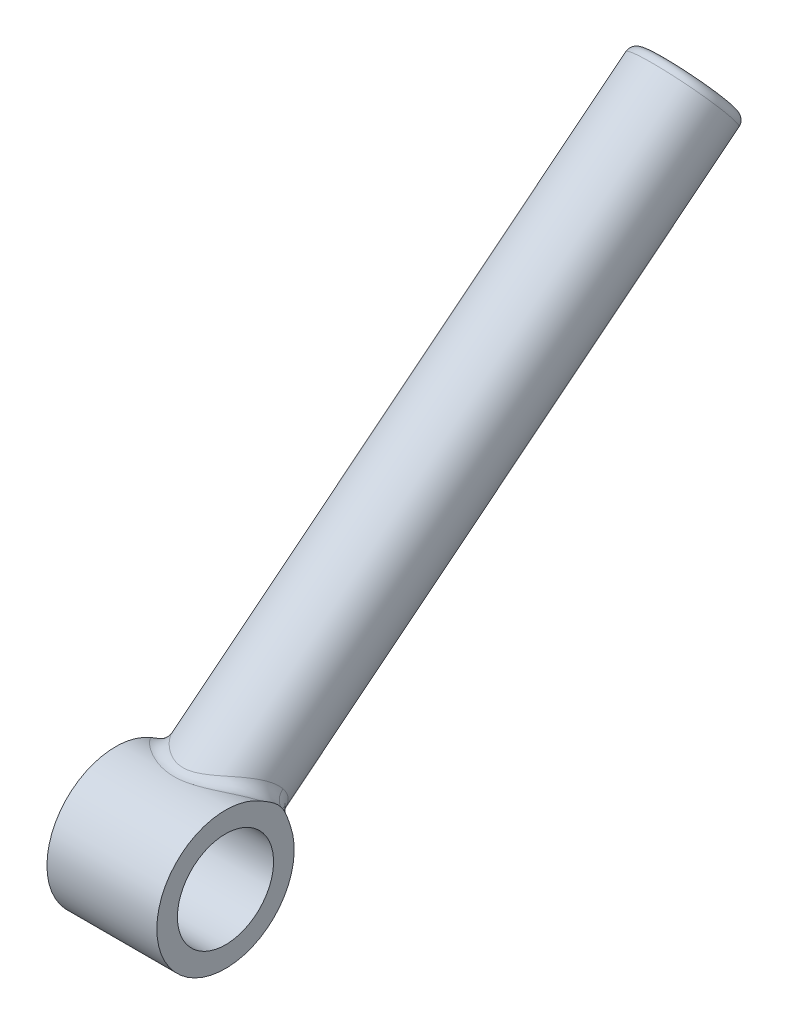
ISO-10303-21;
HEADER;
FILE_DESCRIPTION(('STEP AP214'),'2;1');
FILE_NAME('part.step','',(''),(''),'','','');
FILE_SCHEMA(('AUTOMOTIVE_DESIGN { 1 0 10303 214 1 1 1 1 }'));
ENDSEC;
DATA;
#1=APPLICATION_CONTEXT('core data for automotive mechanical design processes');
#2=APPLICATION_PROTOCOL_DEFINITION('international standard','automotive_design',2000,#1);
#3=PRODUCT_CONTEXT('',#1,'mechanical');
#4=PRODUCT('Part','Part','',(#3));
#5=PRODUCT_RELATED_PRODUCT_CATEGORY('part','',(#4));
#6=PRODUCT_DEFINITION_FORMATION('','',#4);
#7=PRODUCT_DEFINITION_CONTEXT('part definition',#1,'design');
#8=PRODUCT_DEFINITION('design','',#6,#7);
#9=PRODUCT_DEFINITION_SHAPE('','',#8);
#10=(LENGTH_UNIT() NAMED_UNIT(*) SI_UNIT(.MILLI.,.METRE.));
#11=(NAMED_UNIT(*) PLANE_ANGLE_UNIT() SI_UNIT($,.RADIAN.));
#12=(NAMED_UNIT(*) SI_UNIT($,.STERADIAN.) SOLID_ANGLE_UNIT());
#13=UNCERTAINTY_MEASURE_WITH_UNIT(LENGTH_MEASURE(1.E-05),#10,'distance_accuracy_value','');
#14=(GEOMETRIC_REPRESENTATION_CONTEXT(3) GLOBAL_UNCERTAINTY_ASSIGNED_CONTEXT((#13)) GLOBAL_UNIT_ASSIGNED_CONTEXT((#10,
#11,#12)) REPRESENTATION_CONTEXT('',''));
#15=CARTESIAN_POINT('',(0.,0.,0.));
#16=DIRECTION('',(0.,0.,1.));
#17=DIRECTION('',(1.,0.,0.));
#18=AXIS2_PLACEMENT_3D('',#15,#16,#17);
#19=CARTESIAN_POINT('',(0.,-966.608585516,1208.07951372));
#20=DIRECTION('',(0.,-0.624752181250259,0.780823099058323));
#21=DIRECTION('',(0.,-0.780823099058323,-0.624752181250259));
#22=AXIS2_PLACEMENT_3D('',#19,#20,#21);
#23=PLANE('',#22);
#24=CARTESIAN_POINT('',(38.5886120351,-383.173218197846,1674.89782222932));
#25=DIRECTION('',(0.,-0.624752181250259,0.780823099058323));
#26=DIRECTION('',(0.,-0.780823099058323,-0.624752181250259));
#27=AXIS2_PLACEMENT_3D('',#24,#25,#26);
#28=CIRCLE('',#27,10.);
#29=CARTESIAN_POINT('',(38.5886120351,-390.981449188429,1668.65030041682));
#30=VERTEX_POINT('',#29);
#31=EDGE_CURVE('E324',#30,#30,#28,.F.);
#32=ORIENTED_EDGE('',*,*,#31,.T.);
#33=EDGE_LOOP('',(#32));
#34=FACE_BOUND('',#33,.T.);
#35=ADVANCED_FACE('F16',(#34),#23,.F.);
#36=CARTESIAN_POINT('',(38.5886120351,-316.012358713,1590.95933908));
#37=DIRECTION('',(0.,-0.624752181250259,0.780823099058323));
#38=DIRECTION('',(0.,-0.780823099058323,-0.624752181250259));
#39=AXIS2_PLACEMENT_3D('',#36,#37,#38);
#40=CYLINDRICAL_SURFACE('',#39,10.);
#41=ORIENTED_EDGE('',*,*,#31,.F.);
#42=EDGE_LOOP('',(#41));
#43=FACE_BOUND('',#42,.T.);
#44=CARTESIAN_POINT('',(38.5886120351,-250.725755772,1509.36332523));
#45=DIRECTION('',(0.,0.624752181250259,-0.780823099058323));
#46=DIRECTION('',(-0.994729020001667,0.0800645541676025,0.064061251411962));
#47=AXIS2_PLACEMENT_3D('',#44,#45,#46);
#48=CIRCLE('',#47,10.);
#49=CARTESIAN_POINT('',(28.6413218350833,-249.925110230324,1510.00393774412));
#50=VERTEX_POINT('',#49);
#51=EDGE_CURVE('E101',#50,#50,#48,.F.);
#52=ORIENTED_EDGE('',*,*,#51,.F.);
#53=EDGE_LOOP('',(#52));
#54=FACE_BOUND('',#53,.T.);
#55=ADVANCED_FACE('F345',(#43,#54),#40,.F.);
#56=CARTESIAN_POINT('',(38.5886120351,-250.725755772,1509.36332523));
#57=DIRECTION('',(0.,0.624752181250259,-0.780823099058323));
#58=DIRECTION('',(-0.994729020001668,0.0800645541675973,0.0640612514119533));
#59=AXIS2_PLACEMENT_3D('',#56,#57,#58);
#60=TOROIDAL_SURFACE('',#59,13.,3.);
#61=CARTESIAN_POINT('',(38.5886120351,-248.851499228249,1507.02085593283));
#62=DIRECTION('',(0.,0.624752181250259,-0.780823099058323));
#63=DIRECTION('',(-1.,3.61090644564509E-09,2.88915899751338E-09));
#64=AXIS2_PLACEMENT_3D('',#61,#62,#63);
#65=CIRCLE('',#64,13.);
#66=CARTESIAN_POINT('',(25.5886120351,-248.851499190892,1507.02085596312));
#67=VERTEX_POINT('',#66);
#68=CARTESIAN_POINT('',(51.5886120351,-248.851499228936,1507.02085593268));
#69=VERTEX_POINT('',#68);
#70=EDGE_CURVE('E286',#67,#69,#65,.T.);
#71=ORIENTED_EDGE('',*,*,#70,.T.);
#72=CARTESIAN_POINT('',(38.5886120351,-248.851499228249,1507.02085593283));
#73=DIRECTION('',(0.,0.624752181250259,-0.780823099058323));
#74=DIRECTION('',(1.,0.,0.));
#75=AXIS2_PLACEMENT_3D('',#72,#73,#74);
#76=CIRCLE('',#75,13.);
#77=EDGE_CURVE('E296',#69,#67,#76,.T.);
#78=ORIENTED_EDGE('',*,*,#77,.T.);
#79=EDGE_LOOP('',(#71,#78));
#80=FACE_BOUND('',#79,.T.);
#81=ORIENTED_EDGE('',*,*,#51,.T.);
#82=EDGE_LOOP('',(#81));
#83=FACE_BOUND('',#82,.T.);
#84=ADVANCED_FACE('F333',(#80,#83),#60,.T.);
#85=CARTESIAN_POINT('',(-56.4113879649,-399.829040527,1695.71447754));
#86=DIRECTION('',(-1.,0.,0.));
#87=DIRECTION('',(0.,0.,1.));
#88=AXIS2_PLACEMENT_3D('',#85,#86,#87);
#89=CYLINDRICAL_SURFACE('',#88,17.5);
#90=CARTESIAN_POINT('',(58.5886120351,-399.829040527,1695.71447754));
#91=DIRECTION('',(-1.,0.,0.));
#92=DIRECTION('',(0.,0.,1.));
#93=AXIS2_PLACEMENT_3D('',#90,#91,#92);
#94=CIRCLE('',#93,17.5);
#95=CARTESIAN_POINT('',(58.5886120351,-399.829040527,1713.21447754));
#96=VERTEX_POINT('',#95);
#97=EDGE_CURVE('E315',#96,#96,#94,.T.);
#98=ORIENTED_EDGE('',*,*,#97,.F.);
#99=EDGE_LOOP('',(#98));
#100=FACE_BOUND('',#99,.T.);
#101=CARTESIAN_POINT('',(18.5886120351,-399.829040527,1695.71447754));
#102=DIRECTION('',(-1.,0.,0.));
#103=DIRECTION('',(0.,0.,1.));
#104=AXIS2_PLACEMENT_3D('',#101,#102,#103);
#105=CIRCLE('',#104,17.5);
#106=CARTESIAN_POINT('',(18.5886120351,-399.829040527,1713.21447754));
#107=VERTEX_POINT('',#106);
#108=EDGE_CURVE('E130',#107,#107,#105,.T.);
#109=ORIENTED_EDGE('',*,*,#108,.T.);
#110=EDGE_LOOP('',(#109));
#111=FACE_BOUND('',#110,.T.);
#112=ADVANCED_FACE('F344',(#100,#111),#89,.F.);
#113=CARTESIAN_POINT('',(0.,-832.286866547,1040.20254742));
#114=DIRECTION('',(0.,-0.624752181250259,0.780823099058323));
#115=DIRECTION('',(0.,-0.780823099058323,-0.624752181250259));
#116=AXIS2_PLACEMENT_3D('',#113,#114,#115);
#117=PLANE('',#116);
#118=ORIENTED_EDGE('',*,*,#70,.F.);
#119=ORIENTED_EDGE('',*,*,#77,.F.);
#120=EDGE_LOOP('',(#118,#119));
#121=FACE_BOUND('',#120,.T.);
#122=CARTESIAN_POINT('',(38.5886120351,-248.851499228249,1507.02085593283));
#123=DIRECTION('',(0.,-0.624752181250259,0.780823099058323));
#124=DIRECTION('',(-1.,0.,0.));
#125=AXIS2_PLACEMENT_3D('',#122,#123,#124);
#126=CIRCLE('',#125,14.5);
#127=CARTESIAN_POINT('',(24.0886120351,-248.851499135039,1507.02085600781));
#128=VERTEX_POINT('',#127);
#129=CARTESIAN_POINT('',(53.0886120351,-248.851499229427,1507.02085593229));
#130=VERTEX_POINT('',#129);
#131=EDGE_CURVE('E160',#128,#130,#126,.T.);
#132=ORIENTED_EDGE('',*,*,#131,.F.);
#133=CARTESIAN_POINT('',(38.5886120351,-248.851499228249,1507.02085593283));
#134=DIRECTION('',(0.,-0.624752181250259,0.780823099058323));
#135=DIRECTION('',(1.,-8.45626251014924E-11,-6.76546941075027E-11));
#136=AXIS2_PLACEMENT_3D('',#133,#134,#135);
#137=CIRCLE('',#136,14.5);
#138=EDGE_CURVE('E221',#130,#128,#137,.T.);
#139=ORIENTED_EDGE('',*,*,#138,.F.);
#140=EDGE_LOOP('',(#132,#139));
#141=FACE_BOUND('',#140,.T.);
#142=ADVANCED_FACE('F242',(#121,#141),#117,.F.);
#143=CARTESIAN_POINT('',(38.5886120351,-399.829040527,1695.71447754));
#144=DIRECTION('',(1.,0.,0.));
#145=DIRECTION('',(0.,0.,-1.));
#146=AXIS2_PLACEMENT_3D('',#143,#144,#145);
#147=CYLINDRICAL_SURFACE('',#146,25.);
#148=CARTESIAN_POINT('',(58.5886120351,-399.829040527,1695.71447754));
#149=DIRECTION('',(1.,0.,0.));
#150=DIRECTION('',(0.,0.,-1.));
#151=AXIS2_PLACEMENT_3D('',#148,#149,#150);
#152=CIRCLE('',#151,25.);
#153=CARTESIAN_POINT('',(58.5886115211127,-378.454015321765,1682.74881885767));
#154=VERTEX_POINT('',#153);
#155=CARTESIAN_POINT('',(58.5886115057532,-391.868227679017,1672.01583903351));
#156=VERTEX_POINT('',#155);
#157=EDGE_CURVE('E317',#154,#156,#152,.T.);
#158=ORIENTED_EDGE('',*,*,#157,.F.);
#159=CARTESIAN_POINT('',(16.0886120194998,-384.21023596,1676.19390009));
#160=CARTESIAN_POINT('',(16.0886123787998,-383.061264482,1677.11321526));
#161=CARTESIAN_POINT('',(16.2618367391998,-381.979746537,1678.11721236));
#162=CARTESIAN_POINT('',(16.6083405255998,-380.997412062,1679.18059704));
#163=CARTESIAN_POINT('',(17.5517533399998,-379.333857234,1681.25742892));
#164=CARTESIAN_POINT('',(18.9554402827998,-378.053903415,1683.35235902));
#165=CARTESIAN_POINT('',(19.7104358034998,-377.529485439,1684.33613581));
#166=CARTESIAN_POINT('',(21.6454713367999,-376.481637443,1686.5796322));
#167=CARTESIAN_POINT('',(23.9444935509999,-375.799886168,1688.65701913));
#168=CARTESIAN_POINT('',(25.3609948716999,-375.509466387,1689.77138477));
#169=CARTESIAN_POINT('',(28.5733652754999,-375.067001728,1691.94422714));
#170=CARTESIAN_POINT('',(32.2209034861,-374.905001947,1693.54502396));
#171=CARTESIAN_POINT('',(34.2763649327,-374.873053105,1694.19074007));
#172=CARTESIAN_POINT('',(38.5885518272,-374.842426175,1694.84310998));
#173=CARTESIAN_POINT('',(42.9007255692,-374.873051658,1694.19077027));
#174=CARTESIAN_POINT('',(44.9561936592,-374.904998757,1693.54506874));
#175=CARTESIAN_POINT('',(48.6037209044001,-375.066991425,1691.9443026));
#176=CARTESIAN_POINT('',(51.8161106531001,-375.509445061,1689.77147373));
#177=CARTESIAN_POINT('',(53.2326078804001,-375.79985726,1688.65712063));
#178=CARTESIAN_POINT('',(55.5316411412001,-376.481594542,1686.57974441));
#179=CARTESIAN_POINT('',(57.4666928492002,-377.529424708,1684.33625505));
#180=CARTESIAN_POINT('',(58.2217021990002,-378.053839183,1683.35247223));
#181=CARTESIAN_POINT('',(59.6254618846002,-379.33382841,1681.25745951));
#182=CARTESIAN_POINT('',(60.5689175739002,-380.997449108,1679.18054112));
#183=CARTESIAN_POINT('',(60.9153616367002,-381.979754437,1678.11722907));
#184=CARTESIAN_POINT('',(61.0886120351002,-383.061170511,1677.11329034));
#185=CARTESIAN_POINT('',(61.0886120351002,-384.210235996,1676.19390006));
#186=B_SPLINE_CURVE_WITH_KNOTS('',5,(#159,#160,#161,#162,#163,#164,#165,#166,#167,#168,#169,
#170,#171,#172,#173,#174,#175,#176,#177,#178,#179,#180,#181,#182,#183,#184,#185),.UNSPECIFIED.,
.F.,.F.,(6,3,3,3,3,3,3,3,6),(0.,10.0642153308,19.1637970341,31.3192686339,44.9766151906,
58.6339465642,70.7893727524,79.888984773,89.9539416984),.UNSPECIFIED.);
#187=CARTESIAN_POINT('',(18.5886125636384,-378.454015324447,1682.74881882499));
#188=VERTEX_POINT('',#187);
#189=EDGE_CURVE('E88',#154,#188,#186,.F.);
#190=ORIENTED_EDGE('',*,*,#189,.T.);
#191=CARTESIAN_POINT('',(18.5886120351,-399.829040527,1695.71447754));
#192=DIRECTION('',(1.,0.,0.));
#193=DIRECTION('',(0.,0.,-1.));
#194=AXIS2_PLACEMENT_3D('',#191,#192,#193);
#195=CIRCLE('',#194,25.);
#196=CARTESIAN_POINT('',(18.5886120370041,-391.868221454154,1672.01580854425));
#197=VERTEX_POINT('',#196);
#198=EDGE_CURVE('E84',#188,#197,#195,.T.);
#199=ORIENTED_EDGE('',*,*,#198,.T.);
#200=CARTESIAN_POINT('',(58.5886104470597,-391.868227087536,1672.01583888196));
#201=CARTESIAN_POINT('',(58.4463265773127,-392.100440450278,1671.93783315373));
#202=CARTESIAN_POINT('',(58.2992223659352,-392.331116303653,1671.86414358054));
#203=CARTESIAN_POINT('',(57.995786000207,-392.789231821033,1671.72492773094));
#204=CARTESIAN_POINT('',(57.8394437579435,-393.016667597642,1671.65941063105));
#205=CARTESIAN_POINT('',(57.5180847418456,-393.467873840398,1671.53617411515));
#206=CARTESIAN_POINT('',(57.3530585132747,-393.691639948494,1671.47846345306));
#207=CARTESIAN_POINT('',(57.0148246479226,-394.135140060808,1671.37045022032));
#208=CARTESIAN_POINT('',(56.8416079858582,-394.354869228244,1671.32015608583));
#209=CARTESIAN_POINT('',(56.4874309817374,-394.789974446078,1671.22657440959));
#210=CARTESIAN_POINT('',(56.3064614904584,-395.0053448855,1671.18329545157));
#211=CARTESIAN_POINT('',(55.9371476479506,-395.431465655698,1671.10333394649));
#212=CARTESIAN_POINT('',(55.748793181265,-395.642208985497,1671.06666086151));
#213=CARTESIAN_POINT('',(55.3650149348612,-396.058840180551,1670.99949778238));
#214=CARTESIAN_POINT('',(55.1695796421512,-396.264719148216,1670.96901844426));
#215=CARTESIAN_POINT('',(54.7719058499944,-396.671377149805,1670.91383550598));
#216=CARTESIAN_POINT('',(54.5696549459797,-396.872145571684,1670.88914316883));
#217=CARTESIAN_POINT('',(54.1585813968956,-397.26833395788,1670.8451349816));
#218=CARTESIAN_POINT('',(53.9497457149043,-397.463741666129,1670.82583065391));
#219=CARTESIAN_POINT('',(53.525699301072,-397.848950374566,1670.79220275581));
#220=CARTESIAN_POINT('',(53.3104750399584,-398.038737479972,1670.77789071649));
#221=CARTESIAN_POINT('',(52.8738156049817,-398.412431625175,1670.75385247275));
#222=CARTESIAN_POINT('',(52.6523664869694,-398.596323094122,1670.74413760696));
#223=CARTESIAN_POINT('',(52.2033907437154,-398.957931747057,1670.72889647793));
#224=CARTESIAN_POINT('',(51.97584978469,-399.135631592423,1670.7233811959));
#225=CARTESIAN_POINT('',(51.5147949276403,-399.484536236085,1670.71613666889));
#226=CARTESIAN_POINT('',(51.2812662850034,-399.655721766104,1670.71441790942));
#227=CARTESIAN_POINT('',(50.8083137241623,-399.991244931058,1670.71435561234));
#228=CARTESIAN_POINT('',(50.5688745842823,-400.155561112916,1670.71602194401));
#229=CARTESIAN_POINT('',(50.084153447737,-400.476954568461,1670.7223073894));
#230=CARTESIAN_POINT('',(49.8388556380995,-400.63400782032,1670.7269356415));
#231=CARTESIAN_POINT('',(49.3424470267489,-400.940442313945,1670.73870928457));
#232=CARTESIAN_POINT('',(49.0913196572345,-401.08979641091,1670.74586296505));
#233=CARTESIAN_POINT('',(48.5832527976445,-401.380348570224,1670.76223052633));
#234=CARTESIAN_POINT('',(48.3262956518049,-401.521515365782,1670.77145172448));
#235=CARTESIAN_POINT('',(47.8065716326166,-401.795214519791,1670.79152839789));
#236=CARTESIAN_POINT('',(47.5437856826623,-401.927710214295,1670.80239024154));
#237=CARTESIAN_POINT('',(47.0124444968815,-402.183485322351,1670.82528331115));
#238=CARTESIAN_POINT('',(46.7438696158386,-402.306723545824,1670.83731927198));
#239=CARTESIAN_POINT('',(46.2010590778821,-402.543300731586,1670.86206152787));
#240=CARTESIAN_POINT('',(45.9268042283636,-402.656595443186,1670.87477045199));
#241=CARTESIAN_POINT('',(45.3728217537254,-402.872535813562,1670.90034337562));
#242=CARTESIAN_POINT('',(45.0930761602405,-402.975135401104,1670.9132077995));
#243=CARTESIAN_POINT('',(44.5283890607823,-403.168899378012,1670.93857500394));
#244=CARTESIAN_POINT('',(44.2434313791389,-403.260016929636,1670.95107615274));
#245=CARTESIAN_POINT('',(43.6686956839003,-403.430025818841,1670.97521439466));
#246=CARTESIAN_POINT('',(43.3789037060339,-403.508870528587,1670.98684810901));
#247=CARTESIAN_POINT('',(42.794983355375,-403.65356897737,1671.00877899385));
#248=CARTESIAN_POINT('',(42.5008435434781,-403.719377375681,1671.01907145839));
#249=CARTESIAN_POINT('',(41.9088294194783,-403.837295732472,1671.03789300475));
#250=CARTESIAN_POINT('',(41.6109464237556,-403.889363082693,1671.04641658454));
#251=CARTESIAN_POINT('',(41.0121752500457,-403.979179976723,1671.06133488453));
#252=CARTESIAN_POINT('',(40.7112812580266,-404.016891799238,1671.06772399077));
#253=CARTESIAN_POINT('',(40.1073544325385,-404.077496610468,1671.07808485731));
#254=CARTESIAN_POINT('',(39.8043185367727,-404.100359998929,1671.08205178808));
#255=CARTESIAN_POINT('',(39.1971202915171,-404.130916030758,1671.08737253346));
#256=CARTESIAN_POINT('',(38.8929570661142,-404.1385918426,1671.08872344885));
#257=CARTESIAN_POINT('',(38.2846461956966,-404.138596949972,1671.08872421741));
#258=CARTESIAN_POINT('',(37.9804985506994,-404.130927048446,1671.0873742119));
#259=CARTESIAN_POINT('',(37.3733234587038,-404.100366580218,1671.08204682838));
#260=CARTESIAN_POINT('',(37.0702951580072,-404.077492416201,1671.0780722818));
#261=CARTESIAN_POINT('',(36.4663515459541,-404.016850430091,1671.06768692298));
#262=CARTESIAN_POINT('',(36.1654333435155,-403.979110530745,1671.06128067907));
#263=CARTESIAN_POINT('',(35.5665923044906,-403.889228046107,1671.04632200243));
#264=CARTESIAN_POINT('',(35.2686638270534,-403.837122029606,1671.03777502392));
#265=CARTESIAN_POINT('',(34.6765669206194,-403.719129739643,1671.01890737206));
#266=CARTESIAN_POINT('',(34.3823897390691,-403.65328638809,1671.00859224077));
#267=CARTESIAN_POINT('',(33.798436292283,-403.508539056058,1670.98662557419));
#268=CARTESIAN_POINT('',(33.5086480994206,-403.429682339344,1670.9749789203));
#269=CARTESIAN_POINT('',(32.933970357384,-403.259692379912,1670.95083574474));
#270=CARTESIAN_POINT('',(32.6490661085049,-403.168608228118,1670.93834271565));
#271=CARTESIAN_POINT('',(32.0844794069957,-402.974942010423,1670.91301476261));
#272=CARTESIAN_POINT('',(31.8047807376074,-402.872406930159,1670.9001813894));
#273=CARTESIAN_POINT('',(31.250841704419,-402.656588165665,1670.87467666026));
#274=CARTESIAN_POINT('',(30.9765840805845,-402.543348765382,1670.8620048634));
#275=CARTESIAN_POINT('',(30.4337088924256,-402.306840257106,1670.83732291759));
#276=CARTESIAN_POINT('',(30.1650731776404,-402.183613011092,1670.82531032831));
#277=CARTESIAN_POINT('',(29.633573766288,-401.927805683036,1670.80243818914));
#278=CARTESIAN_POINT('',(29.3706912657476,-401.795265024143,1670.7915742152));
#279=CARTESIAN_POINT('',(28.8507849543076,-401.52145535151,1670.77147916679));
#280=CARTESIAN_POINT('',(28.5937420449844,-401.380223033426,1670.76224178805));
#281=CARTESIAN_POINT('',(28.085560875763,-401.089591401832,1670.74586468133));
#282=CARTESIAN_POINT('',(27.8344037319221,-400.940225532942,1670.73871703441));
#283=CARTESIAN_POINT('',(27.3380038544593,-400.63381436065,1670.72696551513));
#284=CARTESIAN_POINT('',(27.0927431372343,-400.476798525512,1670.72235261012));
#285=CARTESIAN_POINT('',(26.6081268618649,-400.155498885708,1670.71609433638));
#286=CARTESIAN_POINT('',(26.3687548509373,-399.991240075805,1670.71443947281));
#287=CARTESIAN_POINT('',(25.8959346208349,-399.655826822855,1670.71451620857));
#288=CARTESIAN_POINT('',(25.6624712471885,-399.484693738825,1670.71623800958));
#289=CARTESIAN_POINT('',(25.2015247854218,-399.13587388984,1670.72348052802));
#290=CARTESIAN_POINT('',(24.9740274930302,-398.958205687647,1670.72899116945));
#291=CARTESIAN_POINT('',(24.5251061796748,-398.596631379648,1670.74421830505));
#292=CARTESIAN_POINT('',(24.3036686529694,-398.412741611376,1670.75392446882));
#293=CARTESIAN_POINT('',(23.8669971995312,-398.039019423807,1670.77794548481));
#294=CARTESIAN_POINT('',(23.6517502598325,-397.849201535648,1670.79224976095));
#295=CARTESIAN_POINT('',(23.2276285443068,-397.463903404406,1670.82586702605));
#296=CARTESIAN_POINT('',(23.0187410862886,-397.26843618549,1670.84516920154));
#297=CARTESIAN_POINT('',(22.607546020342,-396.872110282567,1670.88918081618));
#298=CARTESIAN_POINT('',(22.4052259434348,-396.671263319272,1670.91387922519));
#299=CARTESIAN_POINT('',(22.0074133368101,-396.264444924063,1670.96908158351));
#300=CARTESIAN_POINT('',(21.8119084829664,-396.058484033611,1670.9995743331));
#301=CARTESIAN_POINT('',(21.4280149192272,-395.641706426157,1671.06676501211));
#302=CARTESIAN_POINT('',(21.2396140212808,-395.430899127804,1671.10345166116));
#303=CARTESIAN_POINT('',(20.8702587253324,-395.004704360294,1671.18343109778));
#304=CARTESIAN_POINT('',(20.6892923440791,-394.789325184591,1671.22671267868));
#305=CARTESIAN_POINT('',(20.3351778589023,-394.354273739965,1671.32029072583));
#306=CARTESIAN_POINT('',(20.1620182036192,-394.134608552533,1671.37057634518));
#307=CARTESIAN_POINT('',(19.8239139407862,-393.691264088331,1671.47856373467));
#308=CARTESIAN_POINT('',(19.6589594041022,-393.467590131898,1671.53625622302));
#309=CARTESIAN_POINT('',(19.3377121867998,-393.016536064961,1671.65944979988));
#310=CARTESIAN_POINT('',(19.1814113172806,-392.789159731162,1671.72494331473));
#311=CARTESIAN_POINT('',(18.8780100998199,-392.331103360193,1671.86411798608));
#312=CARTESIAN_POINT('',(18.7309020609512,-392.1004262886,1671.93779215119));
#313=CARTESIAN_POINT('',(18.5886120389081,-391.868211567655,1672.01577910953));
#314=B_SPLINE_CURVE_WITH_KNOTS('',3,(#200,#201,#202,#203,#204,#205,#206,#207,#208,#209,#210,
#211,#212,#213,#214,#215,#216,#217,#218,#219,#220,#221,#222,#223,#224,#225,#226,#227,#228,#229,
#230,#231,#232,#233,#234,#235,#236,#237,#238,#239,#240,#241,#242,#243,#244,#245,#246,#247,#248,
#249,#250,#251,#252,#253,#254,#255,#256,#257,#258,#259,#260,#261,#262,#263,#264,#265,#266,#267,
#268,#269,#270,#271,#272,#273,#274,#275,#276,#277,#278,#279,#280,#281,#282,#283,#284,#285,#286,
#287,#288,#289,#290,#291,#292,#293,#294,#295,#296,#297,#298,#299,#300,#301,#302,#303,#304,#305,
#306,#307,#308,#309,#310,#311,#312,#313),.UNSPECIFIED.,.F.,.F.,(4,2,2,2,2,2,2,2,2,2,2,2,2,2,2,2,
2,2,2,2,2,2,2,2,2,2,2,2,2,2,2,2,2,2,2,2,2,2,2,2,2,2,2,2,2,2,2,2,2,2,2,2,2,2,2,2,4),(0.,
0.849748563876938,1.70044284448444,2.55208329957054,3.40468512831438,4.25832244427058,
5.1131729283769,5.96948191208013,6.82744390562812,7.68722685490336,8.54898276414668,
9.41285320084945,10.2789748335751,11.1474856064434,12.0185321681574,12.8922791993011,
13.7689213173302,14.6487164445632,15.5320188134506,16.4190434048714,17.3098340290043,
18.2043157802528,19.1023356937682,20.003688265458,20.9081227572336,21.8153296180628,
22.7249041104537,23.6362863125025,24.5486779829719,25.4610219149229,26.3723831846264,
27.2820407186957,28.189403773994,29.0939731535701,29.9953267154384,30.8931640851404,
31.787444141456,32.678174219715,33.5653469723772,34.4489675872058,35.3290842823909,
36.2058212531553,37.0794133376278,37.9501962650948,38.8184561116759,39.6844157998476,
40.5482553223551,41.4101219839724,42.2701392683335,43.1284148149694,43.9850479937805,
44.8401375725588,45.693789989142,46.5461347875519,47.3974217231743,48.2478888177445,
49.0976345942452),.UNSPECIFIED.);
#315=EDGE_CURVE('E96',#197,#156,#314,.F.);
#316=ORIENTED_EDGE('',*,*,#315,.T.);
#317=EDGE_LOOP('',(#158,#190,#199,#316));
#318=FACE_BOUND('',#317,.T.);
#319=ADVANCED_FACE('F233',(#318),#147,.T.);
#320=CARTESIAN_POINT('',(58.5886120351,0.,0.));
#321=DIRECTION('',(1.,0.,0.));
#322=DIRECTION('',(0.,0.,-1.));
#323=AXIS2_PLACEMENT_3D('',#320,#321,#322);
#324=PLANE('',#323);
#325=ORIENTED_EDGE('',*,*,#97,.T.);
#326=EDGE_LOOP('',(#325));
#327=FACE_BOUND('',#326,.T.);
#328=CARTESIAN_POINT('',(58.5886120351,-383.791730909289,1675.67084716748));
#329=CARTESIAN_POINT('',(58.5886120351,-383.642683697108,1675.79005734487));
#330=CARTESIAN_POINT('',(58.5886120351,-383.496393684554,1675.9126961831));
#331=CARTESIAN_POINT('',(58.5886120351,-383.209833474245,1676.16406096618));
#332=CARTESIAN_POINT('',(58.5886120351,-383.069548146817,1676.29276965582));
#333=CARTESIAN_POINT('',(58.5886120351,-382.794892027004,1676.55596561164));
#334=CARTESIAN_POINT('',(58.5886120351,-382.660513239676,1676.69044454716));
#335=CARTESIAN_POINT('',(58.5886120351,-382.397432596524,1676.96474406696));
#336=CARTESIAN_POINT('',(58.5886120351,-382.26872873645,1677.10456273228));
#337=CARTESIAN_POINT('',(58.5886120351,-382.017686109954,1677.3879144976));
#338=CARTESIAN_POINT('',(58.5886120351,-381.895306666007,1677.53141163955));
#339=CARTESIAN_POINT('',(58.5886120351,-381.655488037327,1677.82258814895));
#340=CARTESIAN_POINT('',(58.5886120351,-381.538051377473,1677.97026959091));
#341=CARTESIAN_POINT('',(58.5886120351,-381.307705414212,1678.26920987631));
#342=CARTESIAN_POINT('',(58.5886120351,-381.194798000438,1678.42047017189));
#343=CARTESIAN_POINT('',(58.5886120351,-380.973059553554,1678.72593516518));
#344=CARTESIAN_POINT('',(58.5886120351,-380.864228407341,1678.88013978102));
#345=CARTESIAN_POINT('',(58.5886120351,-380.654221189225,1679.1849602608));
#346=CARTESIAN_POINT('',(58.5886120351,-380.552911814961,1679.33548456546));
#347=CARTESIAN_POINT('',(58.5886120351,-380.353050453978,1679.63828915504));
#348=CARTESIAN_POINT('',(58.5886120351,-380.254497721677,1679.7905689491));
#349=CARTESIAN_POINT('',(58.5886120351,-380.059587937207,1680.09651965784));
#350=CARTESIAN_POINT('',(58.5886120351,-379.963230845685,1680.25019054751));
#351=CARTESIAN_POINT('',(58.5886120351,-379.772161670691,1680.55856596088));
#352=CARTESIAN_POINT('',(58.5886120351,-379.677449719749,1680.71327056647));
#353=CARTESIAN_POINT('',(58.5886120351,-379.488390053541,1681.02458067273));
#354=CARTESIAN_POINT('',(58.5886120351,-379.394051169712,1681.18119152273));
#355=CARTESIAN_POINT('',(58.5886120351,-379.20594987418,1681.49475085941));
#356=CARTESIAN_POINT('',(58.5886120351,-379.112187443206,1681.65169933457));
#357=CARTESIAN_POINT('',(58.5886120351,-378.924698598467,1681.96558148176));
#358=CARTESIAN_POINT('',(58.5886120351,-378.830972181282,1682.1225151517));
#359=CARTESIAN_POINT('',(58.5886120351,-378.643016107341,1682.43601389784));
#360=CARTESIAN_POINT('',(58.5886120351,-378.548786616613,1682.59257907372));
#361=CARTESIAN_POINT('',(58.5886120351,-378.454015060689,1682.74881869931));
#362=B_SPLINE_CURVE_WITH_KNOTS('',3,(#328,#329,#330,#331,#332,#333,#334,#335,#336,#337,#338,
#339,#340,#341,#342,#343,#344,#345,#346,#347,#348,#349,#350,#351,#352,#353,#354,#355,#356,#357,
#358,#359,#360,#361),.UNSPECIFIED.,.F.,.F.,(4,2,2,2,2,2,2,2,2,2,2,2,2,2,2,2,4),(0.,
0.572501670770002,1.14346386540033,1.71362779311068,2.28358871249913,2.84925190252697,
3.41520062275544,3.98138305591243,4.54754976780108,5.09184023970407,5.63598204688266,
6.18011409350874,6.72428977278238,7.2727770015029,7.82124579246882,8.36962024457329,
8.91782370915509),.UNSPECIFIED.);
#363=CARTESIAN_POINT('',(58.5886120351,-383.791730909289,1675.67084716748));
#364=VERTEX_POINT('',#363);
#365=EDGE_CURVE('E87',#364,#154,#362,.T.);
#366=ORIENTED_EDGE('',*,*,#365,.T.);
#367=ORIENTED_EDGE('',*,*,#157,.T.);
#368=CARTESIAN_POINT('',(58.5886120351,-391.868227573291,1672.01583871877));
#369=CARTESIAN_POINT('',(58.5886120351,-391.632236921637,1672.09511157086));
#370=CARTESIAN_POINT('',(58.5886120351,-391.395879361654,1672.17327038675));
#371=CARTESIAN_POINT('',(58.5886120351,-390.923561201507,1672.32870039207));
#372=CARTESIAN_POINT('',(58.5886120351,-390.687601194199,1672.40597337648));
#373=CARTESIAN_POINT('',(58.5886120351,-390.216607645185,1672.56116025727));
#374=CARTESIAN_POINT('',(58.5886120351,-389.981573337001,1672.63907181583));
#375=CARTESIAN_POINT('',(58.5886120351,-389.512952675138,1672.79705267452));
#376=CARTESIAN_POINT('',(58.5886120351,-389.279364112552,1672.87711537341));
#377=CARTESIAN_POINT('',(58.5886120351,-388.814159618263,1673.04092215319));
#378=CARTESIAN_POINT('',(58.5886120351,-388.58254012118,1673.12465603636));
#379=CARTESIAN_POINT('',(58.5886120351,-388.121803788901,1673.29734475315));
#380=CARTESIAN_POINT('',(58.5886120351,-387.892682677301,1673.38628809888));
#381=CARTESIAN_POINT('',(58.5886120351,-387.43589769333,1673.5715937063));
#382=CARTESIAN_POINT('',(58.5886120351,-387.208249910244,1673.66799589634));
#383=CARTESIAN_POINT('',(58.5886120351,-386.756871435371,1673.86914101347));
#384=CARTESIAN_POINT('',(58.5886120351,-386.533137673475,1673.97387700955));
#385=CARTESIAN_POINT('',(58.5886120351,-386.090381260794,1674.1931010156));
#386=CARTESIAN_POINT('',(58.5886120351,-385.871360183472,1674.30759222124));
#387=CARTESIAN_POINT('',(58.5886120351,-385.438769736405,1674.54762178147));
#388=CARTESIAN_POINT('',(58.5886120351,-385.225214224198,1674.67318519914));
#389=CARTESIAN_POINT('',(58.5886120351,-384.804186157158,1674.93650396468));
#390=CARTESIAN_POINT('',(58.5886120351,-384.596750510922,1675.07431866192));
#391=CARTESIAN_POINT('',(58.5886120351,-384.291015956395,1675.29051556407));
#392=CARTESIAN_POINT('',(58.5886120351,-384.18958420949,1675.36449846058));
#393=CARTESIAN_POINT('',(58.5886120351,-383.988954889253,1675.51544461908));
#394=CARTESIAN_POINT('',(58.5886120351,-383.889757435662,1675.5924080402));
#395=CARTESIAN_POINT('',(58.5886120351,-383.791730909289,1675.67084716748));
#396=B_SPLINE_CURVE_WITH_KNOTS('',3,(#368,#369,#370,#371,#372,#373,#374,#375,#376,#377,#378,
#379,#380,#381,#382,#383,#384,#385,#386,#387,#388,#389,#390,#391,#392,#393,#394,#395),
.UNSPECIFIED.,.F.,.F.,(4,2,2,2,2,2,2,2,2,2,2,2,2,4),(0.,0.746837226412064,1.49170850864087,
2.23453773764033,2.97530173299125,3.71412440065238,4.451375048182,5.1928891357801,
5.93379284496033,6.6749402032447,7.41781054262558,8.16449924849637,8.54108942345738,
8.91769973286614),.UNSPECIFIED.);
#397=EDGE_CURVE('E73',#156,#364,#396,.T.);
#398=ORIENTED_EDGE('',*,*,#397,.T.);
#399=EDGE_LOOP('',(#366,#367,#398));
#400=FACE_BOUND('',#399,.T.);
#401=ADVANCED_FACE('F114',(#327,#400),#324,.T.);
#402=CARTESIAN_POINT('',(18.5886120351,0.,0.));
#403=DIRECTION('',(1.,0.,0.));
#404=DIRECTION('',(0.,0.,-1.));
#405=AXIS2_PLACEMENT_3D('',#402,#403,#404);
#406=PLANE('',#405);
#407=ORIENTED_EDGE('',*,*,#108,.F.);
#408=EDGE_LOOP('',(#407));
#409=FACE_BOUND('',#408,.T.);
#410=ORIENTED_EDGE('',*,*,#198,.F.);
#411=CARTESIAN_POINT('',(18.5886120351,-378.454015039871,1682.74881865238));
#412=CARTESIAN_POINT('',(18.5886120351,-378.583126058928,1682.53596632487));
#413=CARTESIAN_POINT('',(18.5886120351,-378.711230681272,1682.32251164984));
#414=CARTESIAN_POINT('',(18.5886120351,-378.966486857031,1681.89579487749));
#415=CARTESIAN_POINT('',(18.5886120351,-379.093640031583,1681.68253375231));
#416=CARTESIAN_POINT('',(18.5886120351,-379.348368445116,1681.25705599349));
#417=CARTESIAN_POINT('',(18.5886120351,-379.475941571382,1681.04483809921));
#418=CARTESIAN_POINT('',(18.5886120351,-379.732875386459,1680.6222883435));
#419=CARTESIAN_POINT('',(18.5886120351,-379.862230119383,1680.41195287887));
#420=CARTESIAN_POINT('',(18.5886120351,-380.124098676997,1679.99401418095));
#421=CARTESIAN_POINT('',(18.5886120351,-380.256603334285,1679.78640523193));
#422=CARTESIAN_POINT('',(18.5886120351,-380.526157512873,1679.37477440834));
#423=CARTESIAN_POINT('',(18.5886120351,-380.663196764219,1679.17074584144));
#424=CARTESIAN_POINT('',(18.5886120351,-380.944193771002,1678.76573797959));
#425=CARTESIAN_POINT('',(18.5886120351,-381.088186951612,1678.56478314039));
#426=CARTESIAN_POINT('',(18.5886120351,-381.383451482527,1678.16852474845));
#427=CARTESIAN_POINT('',(18.5886120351,-381.534716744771,1677.97321668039));
#428=CARTESIAN_POINT('',(18.5886120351,-381.845728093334,1677.5893360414));
#429=CARTESIAN_POINT('',(18.5886120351,-382.005476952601,1677.40076570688));
#430=CARTESIAN_POINT('',(18.5886120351,-382.334556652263,1677.03136722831));
#431=CARTESIAN_POINT('',(18.5886120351,-382.503908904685,1676.85055810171));
#432=CARTESIAN_POINT('',(18.5886120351,-382.853173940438,1676.49754915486));
#433=CARTESIAN_POINT('',(18.5886120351,-383.033136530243,1676.32539836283));
#434=CARTESIAN_POINT('',(18.5886120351,-383.311135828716,1676.07453767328));
#435=CARTESIAN_POINT('',(18.5886120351,-383.405567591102,1675.99180613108));
#436=CARTESIAN_POINT('',(18.5886120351,-383.596848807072,1675.82917663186));
#437=CARTESIAN_POINT('',(18.5886120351,-383.693698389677,1675.7492788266));
#438=CARTESIAN_POINT('',(18.5886120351,-383.791730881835,1675.67084716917));
#439=B_SPLINE_CURVE_WITH_KNOTS('',3,(#411,#412,#413,#414,#415,#416,#417,#418,#419,#420,#421,
#422,#423,#424,#425,#426,#427,#428,#429,#430,#431,#432,#433,#434,#435,#436,#437,#438),
.UNSPECIFIED.,.F.,.F.,(4,2,2,2,2,2,2,2,2,2,2,2,2,4),(0.,0.746837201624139,1.49170847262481,
2.23453770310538,2.97530171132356,3.71412440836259,4.45137511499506,5.19288913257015,
5.93379282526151,6.67494019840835,7.41781052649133,8.16449917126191,8.54108931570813,
8.91769959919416),.UNSPECIFIED.);
#440=CARTESIAN_POINT('',(18.588611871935,-383.791730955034,1675.67084724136));
#441=VERTEX_POINT('',#440);
#442=EDGE_CURVE('E79',#188,#441,#439,.T.);
#443=ORIENTED_EDGE('',*,*,#442,.T.);
#444=CARTESIAN_POINT('',(18.5886120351,-383.791730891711,1675.67084718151));
#445=CARTESIAN_POINT('',(18.5886120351,-383.940707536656,1675.55160150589));
#446=CARTESIAN_POINT('',(18.5886120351,-384.092422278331,1675.43579485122));
#447=CARTESIAN_POINT('',(18.5886120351,-384.400467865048,1675.21138763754));
#448=CARTESIAN_POINT('',(18.5886120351,-384.5567851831,1675.10276851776));
#449=CARTESIAN_POINT('',(18.5886120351,-384.873760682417,1674.8925694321));
#450=CARTESIAN_POINT('',(18.5886120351,-385.034412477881,1674.79097982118));
#451=CARTESIAN_POINT('',(18.5886120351,-385.359682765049,1674.5945118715));
#452=CARTESIAN_POINT('',(18.5886120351,-385.524299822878,1674.49963115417));
#453=CARTESIAN_POINT('',(18.5886120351,-385.855761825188,1674.31689365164));
#454=CARTESIAN_POINT('',(18.5886120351,-386.022580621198,1674.22898931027));
#455=CARTESIAN_POINT('',(18.5886120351,-386.35921374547,1674.05891542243));
#456=CARTESIAN_POINT('',(18.5886120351,-386.529029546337,1673.97674879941));
#457=CARTESIAN_POINT('',(18.5886120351,-386.8711566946,1673.81761346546));
#458=CARTESIAN_POINT('',(18.5886120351,-387.043469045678,1673.74064691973));
#459=CARTESIAN_POINT('',(18.5886120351,-387.390070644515,1673.59133255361));
#460=CARTESIAN_POINT('',(18.5886120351,-387.564359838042,1673.51898460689));
#461=CARTESIAN_POINT('',(18.5886120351,-387.90781771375,1673.3809423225));
#462=CARTESIAN_POINT('',(18.5886120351,-388.076926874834,1673.31509928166));
#463=CARTESIAN_POINT('',(18.5886120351,-388.416253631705,1673.18648869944));
#464=CARTESIAN_POINT('',(18.5886120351,-388.586470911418,1673.12372032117));
#465=CARTESIAN_POINT('',(18.5886120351,-388.927781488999,1673.00063199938));
#466=CARTESIAN_POINT('',(18.5886120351,-389.098874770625,1672.94031201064));
#467=CARTESIAN_POINT('',(18.5886120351,-389.441709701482,1672.82150578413));
#468=CARTESIAN_POINT('',(18.5886120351,-389.613451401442,1672.76301969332));
#469=CARTESIAN_POINT('',(18.5886120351,-389.958710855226,1672.64682259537));
#470=CARTESIAN_POINT('',(18.5886120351,-390.13223189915,1672.58912140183));
#471=CARTESIAN_POINT('',(18.5886120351,-390.479478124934,1672.47435886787));
#472=CARTESIAN_POINT('',(18.5886120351,-390.653203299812,1672.41729750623));
#473=CARTESIAN_POINT('',(18.5886120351,-391.000632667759,1672.3032105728));
#474=CARTESIAN_POINT('',(18.5886120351,-391.174336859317,1672.24618499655));
#475=CARTESIAN_POINT('',(18.5886120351,-391.521497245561,1672.13156545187));
#476=CARTESIAN_POINT('',(18.5886120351,-391.694953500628,1672.07397166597));
#477=CARTESIAN_POINT('',(18.5886120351,-391.868211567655,1672.01577910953));
#478=B_SPLINE_CURVE_WITH_KNOTS('',3,(#444,#445,#446,#447,#448,#449,#450,#451,#452,#453,#454,
#455,#456,#457,#458,#459,#460,#461,#462,#463,#464,#465,#466,#467,#468,#469,#470,#471,#472,#473,
#474,#475,#476,#477),.UNSPECIFIED.,.F.,.F.,(4,2,2,2,2,2,2,2,2,2,2,2,2,2,2,2,4),(0.,
0.572403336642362,1.14326566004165,1.71332851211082,2.28318823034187,2.84875223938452,
3.41460233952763,3.98068661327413,4.54675539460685,5.09114555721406,5.63538670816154,
6.17961780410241,6.72389239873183,7.2724796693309,7.82104868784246,8.36952361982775,
8.91782776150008),.UNSPECIFIED.);
#479=EDGE_CURVE('E82',#441,#197,#478,.T.);
#480=ORIENTED_EDGE('',*,*,#479,.T.);
#481=EDGE_LOOP('',(#410,#443,#480));
#482=FACE_BOUND('',#481,.T.);
#483=ADVANCED_FACE('F80',(#409,#482),#406,.F.);
#484=CARTESIAN_POINT('',(61.16715185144,-384.210235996,1676.19390006));
#485=CARTESIAN_POINT('',(61.151443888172,-384.210235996,1676.19390006));
#486=CARTESIAN_POINT('',(61.135735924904,-384.210235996,1676.19390006));
#487=CARTESIAN_POINT('',(61.120027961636,-384.210235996,1676.19390006));
#488=CARTESIAN_POINT('',(61.104319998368,-384.210235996,1676.19390006));
#489=CARTESIAN_POINT('',(61.0886120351,-384.210235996,1676.19390006));
#490=CARTESIAN_POINT('',(60.3032138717,-384.210235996,1676.19390006));
#491=CARTESIAN_POINT('',(59.5178032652,-384.113912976,1676.07351435));
#492=CARTESIAN_POINT('',(58.772819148,-383.921122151,1675.83256196));
#493=CARTESIAN_POINT('',(57.4440578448,-383.36341827,1675.13553666));
#494=CARTESIAN_POINT('',(56.551377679,-382.533271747,1674.09800915));
#495=CARTESIAN_POINT('',(56.2427899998,-382.067841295,1673.51630834));
#496=CARTESIAN_POINT('',(56.0886120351,-381.577154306,1672.9030416));
#497=CARTESIAN_POINT('',(56.0886120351,-381.08647509,1672.28978457));
#498=CARTESIAN_POINT('',(61.16715185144,-383.0563573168,1677.117141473));
#499=CARTESIAN_POINT('',(61.151443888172,-383.05731995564,1677.1163712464));
#500=CARTESIAN_POINT('',(61.135735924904,-383.05828259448,1677.1156010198));
#501=CARTESIAN_POINT('',(61.120027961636,-383.05924523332,1677.1148307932));
#502=CARTESIAN_POINT('',(61.104319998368,-383.06020787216,1677.1140605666));
#503=CARTESIAN_POINT('',(61.0886120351,-383.061170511,1677.11329034));
#504=CARTESIAN_POINT('',(60.3032138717,-383.109302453,1677.07477901));
#505=CARTESIAN_POINT('',(59.5178032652,-383.054025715,1676.92155135));
#506=CARTESIAN_POINT('',(58.772819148,-382.89270662,1676.6554178));
#507=CARTESIAN_POINT('',(57.4440578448,-382.375403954,1675.92606668));
#508=CARTESIAN_POINT('',(56.551377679,-381.53889064,1674.89363336));
#509=CARTESIAN_POINT('',(56.2427899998,-381.058130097,1674.32419847));
#510=CARTESIAN_POINT('',(56.0886120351,-380.540792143,1673.73225569));
#511=CARTESIAN_POINT('',(56.0886120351,-380.01401397,1673.14788216));
#512=CARTESIAN_POINT('',(60.99271973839,-381.9706875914,1678.125644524));
#513=CARTESIAN_POINT('',(60.977248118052,-381.97250096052,1678.1239614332));
#514=CARTESIAN_POINT('',(60.961776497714,-381.97431432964,1678.1222783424));
#515=CARTESIAN_POINT('',(60.946304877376,-381.97612769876,1678.1205952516));
#516=CARTESIAN_POINT('',(60.930833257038,-381.97794106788,1678.1189121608));
#517=CARTESIAN_POINT('',(60.9153616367,-381.979754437,1678.11722907));
#518=CARTESIAN_POINT('',(60.1417806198,-382.070422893,1678.03307453));
#519=CARTESIAN_POINT('',(59.3681878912,-382.0524223,1677.84216796));
#520=CARTESIAN_POINT('',(58.6338177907,-381.920919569,1677.54869147));
#521=CARTESIAN_POINT('',(57.3214988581,-381.444787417,1676.78788046));
#522=CARTESIAN_POINT('',(56.432983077,-380.609341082,1675.76992012));
#523=CARTESIAN_POINT('',(56.1227135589,-380.118269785,1675.21911557));
#524=CARTESIAN_POINT('',(55.9629241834,-379.57994964,1674.65570913));
#525=CARTESIAN_POINT('',(55.9538617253,-379.022731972,1674.10743803));
#526=CARTESIAN_POINT('',(60.64390606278,-380.9852569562,1679.193789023));
#527=CARTESIAN_POINT('',(60.628908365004,-380.98769538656,1679.1911394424));
#528=CARTESIAN_POINT('',(60.613910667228,-380.99013381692,1679.1884898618));
#529=CARTESIAN_POINT('',(60.598912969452,-380.99257224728,1679.1858402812));
#530=CARTESIAN_POINT('',(60.583915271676,-380.99501067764,1679.1831907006));
#531=CARTESIAN_POINT('',(60.5689175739,-380.997449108,1679.18054112));
#532=CARTESIAN_POINT('',(59.8190326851,-381.119370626,1679.04806209));
#533=CARTESIAN_POINT('',(59.069137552,-381.129959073,1678.81849525));
#534=CARTESIAN_POINT('',(58.356047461,-381.022989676,1678.49836849));
#535=CARTESIAN_POINT('',(57.076677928,-380.584824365,1677.71010842));
#536=CARTESIAN_POINT('',(56.1964575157,-379.76064337,1676.71385815));
#537=CARTESIAN_POINT('',(55.8827781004,-379.267401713,1676.18560742));
#538=CARTESIAN_POINT('',(55.7116902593,-378.718372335,1675.6543327));
#539=CARTESIAN_POINT('',(55.6844050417,-378.141992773,1675.1449547));
#540=CARTESIAN_POINT('',(59.69452886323,-379.3178941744,1681.279246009));
#541=CARTESIAN_POINT('',(59.680715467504,-379.32108102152,1681.2748887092));
#542=CARTESIAN_POINT('',(59.666902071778,-379.32426786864,1681.2705314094));
#543=CARTESIAN_POINT('',(59.653088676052,-379.32745471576,1681.2661741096));
#544=CARTESIAN_POINT('',(59.639275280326,-379.33064156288,1681.2618168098));
#545=CARTESIAN_POINT('',(59.6254618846,-379.33382841,1681.25745951));
#546=CARTESIAN_POINT('',(58.9347920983,-379.493170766,1681.03959452));
#547=CARTESIAN_POINT('',(58.2441150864,-379.540731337,1680.74392655));
#548=CARTESIAN_POINT('',(57.5845358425,-379.469109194,1680.38045011));
#549=CARTESIAN_POINT('',(56.3894811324,-379.09412516,1679.55242389));
#550=CARTESIAN_POINT('',(55.5347162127,-378.308395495,1678.60282807));
#551=CARTESIAN_POINT('',(55.215613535,-377.825796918,1678.11771881));
#552=CARTESIAN_POINT('',(55.0198716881,-377.276179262,1677.64508293));
#553=CARTESIAN_POINT('',(54.9506065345,-376.686301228,1677.20466977));
#554=CARTESIAN_POINT('',(58.28320700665,-378.037512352,1683.380881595));
#555=CARTESIAN_POINT('',(58.27090604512,-378.0407777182,1683.375199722));
#556=CARTESIAN_POINT('',(58.25860508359,-378.0440430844,1683.369517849));
#557=CARTESIAN_POINT('',(58.24630412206,-378.0473084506,1683.363835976));
#558=CARTESIAN_POINT('',(58.23400316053,-378.0505738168,1683.358154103));
#559=CARTESIAN_POINT('',(58.221702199,-378.053839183,1683.35247223));
#560=CARTESIAN_POINT('',(57.6066541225,-378.217107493,1683.06837858));
#561=CARTESIAN_POINT('',(56.9916015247,-378.275087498,1682.72510937));
#562=CARTESIAN_POINT('',(56.4011534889,-378.221111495,1682.33415931));
#563=CARTESIAN_POINT('',(55.3184969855,-377.89370162,1681.48964905));
#564=CARTESIAN_POINT('',(54.5079399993,-377.169814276,1680.59004659));
#565=CARTESIAN_POINT('',(54.1897099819,-376.719184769,1680.14398239));
#566=CARTESIAN_POINT('',(53.9718168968,-376.198616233,1679.72020529));
#567=CARTESIAN_POINT('',(53.8587931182,-375.630948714,1679.33411924));
#568=CARTESIAN_POINT('',(57.52445552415,-377.5135081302,1684.367219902));
#569=CARTESIAN_POINT('',(57.51290298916,-377.51669144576,1684.3610269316));
#570=CARTESIAN_POINT('',(57.50135045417,-377.51987476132,1684.3548339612));
#571=CARTESIAN_POINT('',(57.48979791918,-377.52305807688,1684.3486409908));
#572=CARTESIAN_POINT('',(57.47824538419,-377.52624139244,1684.3424480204));
#573=CARTESIAN_POINT('',(57.4666928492,-377.529424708,1684.33625505));
#574=CARTESIAN_POINT('',(56.8890660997,-377.688590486,1684.02660653));
#575=CARTESIAN_POINT('',(56.3114358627,-377.746758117,1683.66597897));
#576=CARTESIAN_POINT('',(55.7554330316,-377.697873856,1683.2660885));
#577=CARTESIAN_POINT('',(54.7297995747,-377.389797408,1682.41905423));
#578=CARTESIAN_POINT('',(53.9446336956,-376.698851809,1681.54240347));
#579=CARTESIAN_POINT('',(53.6291904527,-376.266949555,1681.1128865));
#580=CARTESIAN_POINT('',(53.4031837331,-375.765390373,1680.70888245));
#581=CARTESIAN_POINT('',(53.2715636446,-375.21488798,1680.34404375));
#582=CARTESIAN_POINT('',(55.58060226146,-376.4674791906,1686.615397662));
#583=CARTESIAN_POINT('',(55.570810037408,-376.47030226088,1686.6082670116));
#584=CARTESIAN_POINT('',(55.561017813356,-376.47312533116,1686.6011363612));
#585=CARTESIAN_POINT('',(55.551225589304,-376.47594840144,1686.5940057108));
#586=CARTESIAN_POINT('',(55.541433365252,-376.47877147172,1686.5868750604));
#587=CARTESIAN_POINT('',(55.5316411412,-376.481594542,1686.57974441));
#588=CARTESIAN_POINT('',(55.0420299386,-376.622748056,1686.22321189));
#589=CARTESIAN_POINT('',(54.5524171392,-376.674630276,1685.83287866));
#590=CARTESIAN_POINT('',(54.0780174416,-376.632795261,1685.42018255));
#591=CARTESIAN_POINT('',(53.1900081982,-376.364394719,1684.5770974));
#592=CARTESIAN_POINT('',(52.4736018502,-375.754160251,1683.75134853));
#593=CARTESIAN_POINT('',(52.1708481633,-375.370399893,1683.35599608));
#594=CARTESIAN_POINT('',(51.9333688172,-374.920340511,1682.99096604));
#595=CARTESIAN_POINT('',(51.7665237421,-374.419696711,1682.66641204));
#596=CARTESIAN_POINT('',(53.27286834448,-375.7887667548,1688.694824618));
#597=CARTESIAN_POINT('',(53.264816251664,-375.79098485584,1688.6872838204));
#598=CARTESIAN_POINT('',(53.256764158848,-375.79320295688,1688.6797430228));
#599=CARTESIAN_POINT('',(53.248712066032,-375.79542105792,1688.6722022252));
#600=CARTESIAN_POINT('',(53.240659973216,-375.79763915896,1688.6646614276));
#601=CARTESIAN_POINT('',(53.2326078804,-375.79985726,1688.65712063));
#602=CARTESIAN_POINT('',(52.8300032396,-375.910762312,1688.28008075));
#603=CARTESIAN_POINT('',(52.4273978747,-375.946411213,1687.88167424));
#604=CARTESIAN_POINT('',(52.0350356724,-375.903980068,1687.47175297));
#605=CARTESIAN_POINT('',(51.2912558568,-375.665237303,1686.65071756));
#606=CARTESIAN_POINT('',(50.6643506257,-375.138459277,1685.86882656));
#607=CARTESIAN_POINT('',(50.3888828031,-374.807941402,1685.49805755));
#608=CARTESIAN_POINT('',(50.1586608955,-374.418953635,1685.15729234));
#609=CARTESIAN_POINT('',(49.9783863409,-373.982686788,1684.8543573));
#610=CARTESIAN_POINT('',(51.85153911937,-375.5001338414,1689.809657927));
#611=CARTESIAN_POINT('',(51.844453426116,-375.50199608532,1689.8020210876));
#612=CARTESIAN_POINT('',(51.837367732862,-375.50385832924,1689.7943842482));
#613=CARTESIAN_POINT('',(51.830282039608,-375.50572057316,1689.7867474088));
#614=CARTESIAN_POINT('',(51.823196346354,-375.50758281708,1689.7791105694));
#615=CARTESIAN_POINT('',(51.8161106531,-375.509445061,1689.77147373));
#616=CARTESIAN_POINT('',(51.4618259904,-375.602557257,1689.38963176));
#617=CARTESIAN_POINT('',(51.1075408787,-375.628393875,1688.99191324));
#618=CARTESIAN_POINT('',(50.7612100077,-375.584864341,1688.58710654));
#619=CARTESIAN_POINT('',(50.1003478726,-375.361131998,1687.78229938));
#620=CARTESIAN_POINT('',(49.5307637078,-374.880104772,1687.02293203));
#621=CARTESIAN_POINT('',(49.2757231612,-374.57924404,1686.66357196));
#622=CARTESIAN_POINT('',(49.0563263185,-374.224988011,1686.33294604));
#623=CARTESIAN_POINT('',(48.8766663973,-373.826369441,1686.03781629));
#624=CARTESIAN_POINT('',(48.62912232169,-375.0612198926,1691.982518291));
#625=CARTESIAN_POINT('',(48.624042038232,-375.06237419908,1691.9748751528));
#626=CARTESIAN_POINT('',(48.618961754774,-375.06352850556,1691.9672320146));
#627=CARTESIAN_POINT('',(48.613881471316,-375.06468281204,1691.9595888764));
#628=CARTESIAN_POINT('',(48.608801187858,-375.06583711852,1691.9519457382));
#629=CARTESIAN_POINT('',(48.6037209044,-375.066991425,1691.9443026));
#630=CARTESIAN_POINT('',(48.3497067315,-375.124706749,1691.56214569));
#631=CARTESIAN_POINT('',(48.0956924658,-375.131014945,1691.17290279));
#632=CARTESIAN_POINT('',(47.8457533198,-375.085010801,1690.78315684));
#633=CARTESIAN_POINT('',(47.3621719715,-374.890006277,1690.01622703));
#634=CARTESIAN_POINT('',(46.9260494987,-374.498826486,1689.29978512));
#635=CARTESIAN_POINT('',(46.7235718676,-374.256633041,1688.96053116));
#636=CARTESIAN_POINT('',(46.5400365,-373.971914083,1688.64613959));
#637=CARTESIAN_POINT('',(46.3781412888,-373.650014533,1688.36149721));
#638=CARTESIAN_POINT('',(44.97183404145,-374.9018125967,1693.582149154));
#639=CARTESIAN_POINT('',(44.968705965,-374.90244982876,1693.5747330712));
#640=CARTESIAN_POINT('',(44.96557788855,-374.90308706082,1693.5673169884));
#641=CARTESIAN_POINT('',(44.9624498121,-374.90372429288,1693.5599009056));
#642=CARTESIAN_POINT('',(44.95932173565,-374.90436152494,1693.5524848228));
#643=CARTESIAN_POINT('',(44.9561936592,-374.904998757,1693.54506874));
#644=CARTESIAN_POINT('',(44.7997898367,-374.93686036,1693.1742646));
#645=CARTESIAN_POINT('',(44.6433859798,-374.929149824,1692.80028642));
#646=CARTESIAN_POINT('',(44.488899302,-374.881477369,1692.42801425));
#647=CARTESIAN_POINT('',(44.1875933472,-374.707489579,1691.69679499));
#648=CARTESIAN_POINT('',(43.9087449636,-374.382705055,1691.0108696));
#649=CARTESIAN_POINT('',(43.7767168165,-374.184228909,1690.68389338));
#650=CARTESIAN_POINT('',(43.653729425,-373.95226485,1690.37726783));
#651=CARTESIAN_POINT('',(43.5411753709,-373.690196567,1690.09472941));
#652=CARTESIAN_POINT('',(42.91119606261,-374.8708323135,1694.227198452));
#653=CARTESIAN_POINT('',(42.909101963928,-374.8712761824,1694.2199128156));
#654=CARTESIAN_POINT('',(42.907007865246,-374.8717200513,1694.2126271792));
#655=CARTESIAN_POINT('',(42.904913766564,-374.8721639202,1694.2053415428));
#656=CARTESIAN_POINT('',(42.902819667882,-374.8726077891,1694.1980559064));
#657=CARTESIAN_POINT('',(42.9007255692,-374.873051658,1694.19077027));
#658=CARTESIAN_POINT('',(42.7960206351,-374.895245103,1693.82648845));
#659=CARTESIAN_POINT('',(42.6913156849,-374.882493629,1693.46010613));
#660=CARTESIAN_POINT('',(42.5877502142,-374.834539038,1693.09587153));
#661=CARTESIAN_POINT('',(42.3851765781,-374.669355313,1692.38028907));
#662=CARTESIAN_POINT('',(42.1959801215,-374.371026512,1691.70667562));
#663=CARTESIAN_POINT('',(42.1057922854,-374.189921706,1691.38441165));
#664=CARTESIAN_POINT('',(42.0210068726,-373.979006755,1691.08049184));
#665=CARTESIAN_POINT('',(41.9424780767,-373.74105084,1690.79820813));
#666=CARTESIAN_POINT('',(38.58855168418,-374.8411835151,1694.878872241));
#667=CARTESIAN_POINT('',(38.588551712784,-374.84143204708,1694.8717197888));
#668=CARTESIAN_POINT('',(38.588551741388,-374.84168057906,1694.8645673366));
#669=CARTESIAN_POINT('',(38.588551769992,-374.84192911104,1694.8574148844));
#670=CARTESIAN_POINT('',(38.588551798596,-374.84217764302,1694.8502624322));
#671=CARTESIAN_POINT('',(38.5885518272,-374.842426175,1694.84310998));
#672=CARTESIAN_POINT('',(38.5885532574,-374.854852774,1694.48548737));
#673=CARTESIAN_POINT('',(38.5885546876,-374.837006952,1694.12683754));
#674=CARTESIAN_POINT('',(38.5885561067,-374.788765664,1693.77076853));
#675=CARTESIAN_POINT('',(38.5885589,-374.63247681,1693.07104686));
#676=CARTESIAN_POINT('',(38.5885615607,-374.360888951,1692.40988501));
#677=CARTESIAN_POINT('',(38.5885628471,-374.197345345,1692.09237694));
#678=CARTESIAN_POINT('',(38.5885640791,-374.00771274,1691.79117755));
#679=CARTESIAN_POINT('',(38.5885652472,-373.794139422,1691.50913367));
#680=CARTESIAN_POINT('',(34.26589410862,-374.8708337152,1694.227168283));
#681=CARTESIAN_POINT('',(34.267988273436,-374.87127759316,1694.2198826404));
#682=CARTESIAN_POINT('',(34.270082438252,-374.87172147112,1694.2125969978));
#683=CARTESIAN_POINT('',(34.272176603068,-374.87216534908,1694.2053113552));
#684=CARTESIAN_POINT('',(34.274270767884,-374.87260922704,1694.1980257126));
#685=CARTESIAN_POINT('',(34.2763649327,-374.873053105,1694.19074007));
#686=CARTESIAN_POINT('',(34.3810731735,-374.895247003,1693.82645794));
#687=CARTESIAN_POINT('',(34.4857814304,-374.882495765,1693.46007527));
#688=CARTESIAN_POINT('',(34.589350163,-374.834541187,1693.09584029));
#689=CARTESIAN_POINT('',(34.791930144,-374.669357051,1692.3802571));
#690=CARTESIAN_POINT('',(34.9811324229,-374.371027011,1691.70664307));
#691=CARTESIAN_POINT('',(35.0713229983,-374.189921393,1691.38437888));
#692=CARTESIAN_POINT('',(35.1561109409,-373.979005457,1691.08045895));
#693=CARTESIAN_POINT('',(35.2346420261,-373.741048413,1690.79817523));
#694=CARTESIAN_POINT('',(32.20526278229,-374.9018157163,1693.582104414));
#695=CARTESIAN_POINT('',(32.208390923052,-374.90245296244,1693.5746883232));
#696=CARTESIAN_POINT('',(32.211519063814,-374.90309020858,1693.5672722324));
#697=CARTESIAN_POINT('',(32.214647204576,-374.90372745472,1693.5598561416));
#698=CARTESIAN_POINT('',(32.217775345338,-374.90436470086,1693.5524400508));
#699=CARTESIAN_POINT('',(32.2209034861,-374.905001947,1693.54502396));
#700=CARTESIAN_POINT('',(32.3773105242,-374.936864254,1693.17421942));
#701=CARTESIAN_POINT('',(32.5337175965,-374.92915411,1692.80024076));
#702=CARTESIAN_POINT('',(32.6882074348,-374.881481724,1692.42796807));
#703=CARTESIAN_POINT('',(32.9895194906,-374.707493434,1691.69674777));
#704=CARTESIAN_POINT('',(33.2683733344,-374.38270721,1691.01082153));
#705=CARTESIAN_POINT('',(33.400404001,-374.184229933,1690.68384497));
#706=CARTESIAN_POINT('',(33.523393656,-373.952264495,1690.37721921));
#707=CARTESIAN_POINT('',(33.6359496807,-373.69019463,1690.09468074));
#708=CARTESIAN_POINT('',(28.54796346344,-375.0612300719,1691.982442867));
#709=CARTESIAN_POINT('',(28.553043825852,-375.06238440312,1691.9747997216));
#710=CARTESIAN_POINT('',(28.558124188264,-375.06353873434,1691.9671565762));
#711=CARTESIAN_POINT('',(28.563204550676,-375.06469306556,1691.9595134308));
#712=CARTESIAN_POINT('',(28.568284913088,-375.06584739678,1691.9518702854));
#713=CARTESIAN_POINT('',(28.5733652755,-375.067001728,1691.94422714));
#714=CARTESIAN_POINT('',(28.8273833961,-375.124718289,1691.56206987));
#715=CARTESIAN_POINT('',(29.0814016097,-375.131027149,1691.17282638));
#716=CARTESIAN_POINT('',(29.3313445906,-375.085023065,1690.78307969));
#717=CARTESIAN_POINT('',(29.8149331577,-374.89001747,1690.01614831));
#718=CARTESIAN_POINT('',(30.251061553,-374.498834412,1689.29970495));
#719=CARTESIAN_POINT('',(30.4535417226,-374.256638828,1688.96045038));
#720=CARTESIAN_POINT('',(30.637079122,-373.971917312,1688.6460584));
#721=CARTESIAN_POINT('',(30.7989757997,-373.65001489,1688.36141586));
#722=CARTESIAN_POINT('',(25.32556601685,-375.5001550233,1689.809568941));
#723=CARTESIAN_POINT('',(25.33265178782,-375.50201729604,1689.8019321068));
#724=CARTESIAN_POINT('',(25.33973755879,-375.50387956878,1689.7942952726));
#725=CARTESIAN_POINT('',(25.34682332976,-375.50574184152,1689.7866584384));
#726=CARTESIAN_POINT('',(25.35390910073,-375.50760411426,1689.7790216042));
#727=CARTESIAN_POINT('',(25.3609948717,-375.509466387,1689.77138477));
#728=CARTESIAN_POINT('',(25.7152834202,-375.602580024,1689.38954306));
#729=CARTESIAN_POINT('',(26.0695724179,-375.628417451,1688.99182438));
#730=CARTESIAN_POINT('',(26.4159070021,-375.584888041,1688.5870172));
#731=CARTESIAN_POINT('',(27.0767758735,-375.361154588,1687.78220865));
#732=CARTESIAN_POINT('',(27.6463648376,-374.880123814,1687.02283953));
#733=CARTESIAN_POINT('',(27.9014071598,-374.579260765,1686.66347857));
#734=CARTESIAN_POINT('',(28.120805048,-374.225002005,1686.33285189));
#735=CARTESIAN_POINT('',(28.3004652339,-373.826380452,1686.03772157));
#736=CARTESIAN_POINT('',(23.90423266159,-375.7887955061,1688.694723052));
#737=CARTESIAN_POINT('',(23.912284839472,-375.79101363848,1688.6871822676));
#738=CARTESIAN_POINT('',(23.920337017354,-375.79323177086,1688.6796414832));
#739=CARTESIAN_POINT('',(23.928389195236,-375.79544990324,1688.6721006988));
#740=CARTESIAN_POINT('',(23.936441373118,-375.79766803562,1688.6645599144));
#741=CARTESIAN_POINT('',(23.944493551,-375.799886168,1688.65701913));
#742=CARTESIAN_POINT('',(24.3471024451,-375.910792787,1688.27997991));
#743=CARTESIAN_POINT('',(24.7497120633,-375.94644256,1687.88157353));
#744=CARTESIAN_POINT('',(25.1420783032,-375.904011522,1687.47165195));
#745=CARTESIAN_POINT('',(25.8858653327,-375.665267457,1686.65061528));
#746=CARTESIAN_POINT('',(26.5127753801,-375.138485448,1685.86872225));
#747=CARTESIAN_POINT('',(26.7882448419,-374.807964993,1685.49795217));
#748=CARTESIAN_POINT('',(27.0184674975,-374.418974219,1685.15718596));
#749=CARTESIAN_POINT('',(27.1987418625,-373.982704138,1684.85425008));
#750=CARTESIAN_POINT('',(21.59650975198,-376.467521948,1686.615285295));
#751=CARTESIAN_POINT('',(21.606302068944,-376.470345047,1686.608154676));
#752=CARTESIAN_POINT('',(21.616094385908,-376.473168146,1686.601024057));
#753=CARTESIAN_POINT('',(21.625886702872,-376.475991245,1686.593893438));
#754=CARTESIAN_POINT('',(21.635679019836,-376.478814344,1686.586762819));
#755=CARTESIAN_POINT('',(21.6454713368,-376.481637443,1686.5796322));
#756=CARTESIAN_POINT('',(22.135087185,-376.622792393,1686.22310125));
#757=CARTESIAN_POINT('',(22.6247046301,-376.67467533,1685.83276884));
#758=CARTESIAN_POINT('',(23.0991086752,-376.63284022,1685.42007285));
#759=CARTESIAN_POINT('',(23.9871254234,-376.364437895,1684.57698683));
#760=CARTESIAN_POINT('',(24.7035360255,-375.754198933,1683.75123548));
#761=CARTESIAN_POINT('',(25.0062908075,-375.370435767,1683.35588153));
#762=CARTESIAN_POINT('',(25.2437700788,-374.920373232,1682.99084993));
#763=CARTESIAN_POINT('',(25.4106138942,-374.419726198,1682.66629444));
#764=CARTESIAN_POINT('',(19.65267267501,-377.5135687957,1684.367100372));
#765=CARTESIAN_POINT('',(19.664225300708,-377.51675212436,1684.3609074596));
#766=CARTESIAN_POINT('',(19.675777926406,-377.51993545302,1684.3547145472));
#767=CARTESIAN_POINT('',(19.687330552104,-377.52311878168,1684.3485216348));
#768=CARTESIAN_POINT('',(19.698883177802,-377.52630211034,1684.3423287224));
#769=CARTESIAN_POINT('',(19.7104358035,-377.529485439,1684.33613581));
#770=CARTESIAN_POINT('',(20.2880670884,-377.688651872,1684.02649019));
#771=CARTESIAN_POINT('',(20.8657018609,-377.746819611,1683.66586457));
#772=CARTESIAN_POINT('',(21.4217088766,-377.697934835,1683.26597506));
#773=CARTESIAN_POINT('',(22.4473493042,-377.389856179,1682.41894095));
#774=CARTESIAN_POINT('',(23.2325184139,-376.698906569,1681.54228747));
#775=CARTESIAN_POINT('',(23.5479620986,-376.267001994,1681.11276857));
#776=CARTESIAN_POINT('',(23.7739679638,-375.765440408,1680.70876225));
#777=CARTESIAN_POINT('',(23.9055859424,-375.214935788,1680.34392112));
#778=CARTESIAN_POINT('',(18.89393506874,-378.0375765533,1683.380768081));
#779=CARTESIAN_POINT('',(18.906236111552,-378.04084192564,1683.3750862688));
#780=CARTESIAN_POINT('',(18.918537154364,-378.04410729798,1683.3694044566));
#781=CARTESIAN_POINT('',(18.930838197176,-378.04737267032,1683.3637226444));
#782=CARTESIAN_POINT('',(18.943139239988,-378.05063804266,1683.3580408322));
#783=CARTESIAN_POINT('',(18.9554402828,-378.053903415,1683.35235902));
#784=CARTESIAN_POINT('',(19.5704924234,-378.217172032,1683.06826841));
#785=CARTESIAN_POINT('',(20.1855490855,-378.275151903,1682.72500129));
#786=CARTESIAN_POINT('',(20.7760008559,-378.22117526,1682.33405237));
#787=CARTESIAN_POINT('',(21.8586635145,-377.893763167,1681.4895426));
#788=CARTESIAN_POINT('',(22.6692231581,-377.169872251,1680.58993763));
#789=CARTESIAN_POINT('',(22.9874534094,-376.719240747,1680.14387157));
#790=CARTESIAN_POINT('',(23.2053455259,-376.198670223,1679.72009221));
#791=CARTESIAN_POINT('',(23.3183671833,-375.631000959,1679.33400371));
#792=CARTESIAN_POINT('',(17.48268626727,-379.3179231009,1681.279215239));
#793=CARTESIAN_POINT('',(17.496499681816,-379.32110992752,1681.2748579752));
#794=CARTESIAN_POINT('',(17.510313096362,-379.32429675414,1681.2705007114));
#795=CARTESIAN_POINT('',(17.524126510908,-379.32748358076,1681.2661434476));
#796=CARTESIAN_POINT('',(17.537939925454,-379.33067040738,1681.2617861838));
#797=CARTESIAN_POINT('',(17.55175334,-379.333857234,1681.25742892));
#798=CARTESIAN_POINT('',(18.2424240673,-379.493198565,1681.03956573));
#799=CARTESIAN_POINT('',(18.9331020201,-379.540758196,1680.74389919));
#800=CARTESIAN_POINT('',(19.5926820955,-379.469135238,1680.38042374));
#801=CARTESIAN_POINT('',(20.7877380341,-379.094149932,1679.55239848));
#802=CARTESIAN_POINT('',(21.6425030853,-378.308419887,1678.60280175));
#803=CARTESIAN_POINT('',(21.9616054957,-377.825821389,1678.11769158));
#804=CARTESIAN_POINT('',(22.1573467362,-377.276204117,1677.64505445));
#805=CARTESIAN_POINT('',(22.2266109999,-376.686326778,1677.2046398));
#806=CARTESIAN_POINT('',(16.53335225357,-380.9852198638,1679.19384517));
#807=CARTESIAN_POINT('',(16.548349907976,-380.98765830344,1679.191195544));
#808=CARTESIAN_POINT('',(16.563347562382,-380.99009674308,1679.188545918));
#809=CARTESIAN_POINT('',(16.578345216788,-380.99253518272,1679.185896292));
#810=CARTESIAN_POINT('',(16.593342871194,-380.99497362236,1679.183246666));
#811=CARTESIAN_POINT('',(16.6083405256,-380.997412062,1679.18059704));
#812=CARTESIAN_POINT('',(17.3582232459,-381.119334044,1679.04811574));
#813=CARTESIAN_POINT('',(18.1081162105,-381.129923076,1678.81854721));
#814=CARTESIAN_POINT('',(18.8212043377,-381.022954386,1678.49841942));
#815=CARTESIAN_POINT('',(20.100570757,-380.584790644,1677.7101586));
#816=CARTESIAN_POINT('',(20.9807901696,-379.760611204,1676.71390993));
#817=CARTESIAN_POINT('',(21.2944697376,-379.267370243,1676.18566051));
#818=CARTESIAN_POINT('',(21.4655584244,-378.71834137,1675.65438748));
#819=CARTESIAN_POINT('',(21.4928451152,-378.141962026,1675.14501137));
#820=CARTESIAN_POINT('',(16.184478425,-381.9706795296,1678.125627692));
#821=CARTESIAN_POINT('',(16.19995008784,-381.97249293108,1678.1239446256));
#822=CARTESIAN_POINT('',(16.21542175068,-381.97430633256,1678.1222615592));
#823=CARTESIAN_POINT('',(16.23089341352,-381.97611973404,1678.1205784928));
#824=CARTESIAN_POINT('',(16.24636507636,-381.97793313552,1678.1188954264));
#825=CARTESIAN_POINT('',(16.2618367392,-381.979746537,1678.11721236));
#826=CARTESIAN_POINT('',(17.0354198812,-382.070416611,1678.03305904));
#827=CARTESIAN_POINT('',(17.8090147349,-382.052417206,1677.84215325));
#828=CARTESIAN_POINT('',(18.5433867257,-381.920915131,1677.54867707));
#829=CARTESIAN_POINT('',(19.8557085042,-381.444783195,1676.7878658));
#830=CARTESIAN_POINT('',(20.7442247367,-380.609335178,1675.76990387));
#831=CARTESIAN_POINT('',(21.054493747,-380.118262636,1675.21909827));
#832=CARTESIAN_POINT('',(21.2142818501,-379.579941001,1674.65569071));
#833=CARTESIAN_POINT('',(21.2233423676,-379.022721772,1674.10741855));
#834=CARTESIAN_POINT('',(16.0100725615,-383.0564516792,1677.117066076));
#835=CARTESIAN_POINT('',(16.02578052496,-383.05741423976,1677.1162959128));
#836=CARTESIAN_POINT('',(16.04148848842,-383.05837680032,1677.1155257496));
#837=CARTESIAN_POINT('',(16.05719645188,-383.05933936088,1677.1147555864));
#838=CARTESIAN_POINT('',(16.07290441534,-383.06030192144,1677.1139854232));
#839=CARTESIAN_POINT('',(16.0886123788,-383.061264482,1677.11321526));
#840=CARTESIAN_POINT('',(16.8740105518,-383.10939251,1677.0747071));
#841=CARTESIAN_POINT('',(17.6594211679,-383.054112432,1676.92148214));
#842=CARTESIAN_POINT('',(18.4044052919,-382.892790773,1676.65535067));
#843=CARTESIAN_POINT('',(19.7331665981,-382.375484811,1675.92600221));
#844=CARTESIAN_POINT('',(20.6258467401,-381.538972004,1674.89356845));
#845=CARTESIAN_POINT('',(20.9344343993,-381.058212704,1674.32413255));
#846=CARTESIAN_POINT('',(21.0886123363,-380.540876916,1673.73218801));
#847=CARTESIAN_POINT('',(21.0886123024,-380.014101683,1673.14781211));
#848=CARTESIAN_POINT('',(16.0100722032,-384.2102359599,1676.193900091));
#849=CARTESIAN_POINT('',(16.02578016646,-384.21023595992,1676.1939000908));
#850=CARTESIAN_POINT('',(16.04148812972,-384.21023595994,1676.1939000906));
#851=CARTESIAN_POINT('',(16.05719609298,-384.21023595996,1676.1939000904));
#852=CARTESIAN_POINT('',(16.07290405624,-384.21023595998,1676.1939000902));
#853=CARTESIAN_POINT('',(16.0886120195,-384.21023596,1676.19390009));
#854=CARTESIAN_POINT('',(16.8740101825,-384.210235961,1676.19390008));
#855=CARTESIAN_POINT('',(17.6594207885,-384.113912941,1676.07351437));
#856=CARTESIAN_POINT('',(18.4044049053,-383.921122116,1675.83256198));
#857=CARTESIAN_POINT('',(19.7331662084,-383.363418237,1675.13553668));
#858=CARTESIAN_POINT('',(20.6258463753,-382.533271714,1674.09800916));
#859=CARTESIAN_POINT('',(20.9344340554,-382.067841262,1673.51630836));
#860=CARTESIAN_POINT('',(21.0886120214,-381.577154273,1672.90304162));
#861=CARTESIAN_POINT('',(21.088612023,-381.086475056,1672.28978459));
#862=B_SPLINE_SURFACE_WITH_KNOTS('',5,5,((#484,#485,#486,#487,#488,#489,#490,#491,#492,#493,
#494,#495,#496,#497),(#498,#499,#500,#501,#502,#503,#504,#505,#506,#507,#508,#509,#510,#511),
(#512,#513,#514,#515,#516,#517,#518,#519,#520,#521,#522,#523,#524,#525),(#526,#527,#528,#529,
#530,#531,#532,#533,#534,#535,#536,#537,#538,#539),(#540,#541,#542,#543,#544,#545,#546,#547,
#548,#549,#550,#551,#552,#553),(#554,#555,#556,#557,#558,#559,#560,#561,#562,#563,#564,#565,
#566,#567),(#568,#569,#570,#571,#572,#573,#574,#575,#576,#577,#578,#579,#580,#581),(#582,#583,
#584,#585,#586,#587,#588,#589,#590,#591,#592,#593,#594,#595),(#596,#597,#598,#599,#600,#601,
#602,#603,#604,#605,#606,#607,#608,#609),(#610,#611,#612,#613,#614,#615,#616,#617,#618,#619,
#620,#621,#622,#623),(#624,#625,#626,#627,#628,#629,#630,#631,#632,#633,#634,#635,#636,#637),
(#638,#639,#640,#641,#642,#643,#644,#645,#646,#647,#648,#649,#650,#651),(#652,#653,#654,#655,
#656,#657,#658,#659,#660,#661,#662,#663,#664,#665),(#666,#667,#668,#669,#670,#671,#672,#673,
#674,#675,#676,#677,#678,#679),(#680,#681,#682,#683,#684,#685,#686,#687,#688,#689,#690,#691,
#692,#693),(#694,#695,#696,#697,#698,#699,#700,#701,#702,#703,#704,#705,#706,#707),(#708,#709,
#710,#711,#712,#713,#714,#715,#716,#717,#718,#719,#720,#721),(#722,#723,#724,#725,#726,#727,
#728,#729,#730,#731,#732,#733,#734,#735),(#736,#737,#738,#739,#740,#741,#742,#743,#744,#745,
#746,#747,#748,#749),(#750,#751,#752,#753,#754,#755,#756,#757,#758,#759,#760,#761,#762,#763),
(#764,#765,#766,#767,#768,#769,#770,#771,#772,#773,#774,#775,#776,#777),(#778,#779,#780,#781,
#782,#783,#784,#785,#786,#787,#788,#789,#790,#791),(#792,#793,#794,#795,#796,#797,#798,#799,
#800,#801,#802,#803,#804,#805),(#806,#807,#808,#809,#810,#811,#812,#813,#814,#815,#816,#817,
#818,#819),(#820,#821,#822,#823,#824,#825,#826,#827,#828,#829,#830,#831,#832,#833),(#834,#835,
#836,#837,#838,#839,#840,#841,#842,#843,#844,#845,#846,#847),(#848,#849,#850,#851,#852,#853,
#854,#855,#856,#857,#858,#859,#860,#861)),.UNSPECIFIED.,.F.,.F.,.F.,(6,3,3,3,3,3,3,3,6),(6,5,3,
6),(0.,10.0649569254,19.164568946,31.3199951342,44.9773265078,58.6346730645,70.7901446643,
79.8897263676,89.9539416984),(-0.05,0.,2.5,5.),.UNSPECIFIED.);
#863=CARTESIAN_POINT('',(61.0886120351,-384.210235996,1676.19390006));
#864=CARTESIAN_POINT('',(60.3032138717,-384.210235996,1676.19390006));
#865=CARTESIAN_POINT('',(59.5178032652,-384.113912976,1676.07351435));
#866=CARTESIAN_POINT('',(58.772819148,-383.921122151,1675.83256196));
#867=CARTESIAN_POINT('',(57.4440578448,-383.36341827,1675.13553666));
#868=CARTESIAN_POINT('',(56.551377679,-382.533271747,1674.09800915));
#869=CARTESIAN_POINT('',(56.2427899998,-382.067841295,1673.51630834));
#870=CARTESIAN_POINT('',(56.0886120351,-381.577154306,1672.9030416));
#871=CARTESIAN_POINT('',(56.0886120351,-381.08647509,1672.28978457));
#872=B_SPLINE_CURVE_WITH_KNOTS('',5,(#863,#864,#865,#866,#867,#868,#869,#870,#871),
.UNSPECIFIED.,.F.,.F.,(6,3,6),(0.,2.5,5.),.UNSPECIFIED.);
#873=CARTESIAN_POINT('',(56.0886120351,-381.08647509,1672.28978457));
#874=VERTEX_POINT('',#873);
#875=EDGE_CURVE('E94',#364,#874,#872,.T.);
#876=CARTESIAN_POINT('',(56.0886120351,-381.08647509,1672.28978457));
#877=CARTESIAN_POINT('',(56.0886120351,-380.01401397,1673.14788216));
#878=CARTESIAN_POINT('',(55.9538617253,-379.022731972,1674.10743803));
#879=CARTESIAN_POINT('',(55.6844050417,-378.141992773,1675.1449547));
#880=CARTESIAN_POINT('',(54.9506065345,-376.686301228,1677.20466977));
#881=CARTESIAN_POINT('',(53.8587931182,-375.630948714,1679.33411924));
#882=CARTESIAN_POINT('',(53.2715636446,-375.21488798,1680.34404375));
#883=CARTESIAN_POINT('',(51.7665237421,-374.419696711,1682.66641204));
#884=CARTESIAN_POINT('',(49.9783863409,-373.982686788,1684.8543573));
#885=CARTESIAN_POINT('',(48.8766663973,-373.826369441,1686.03781629));
#886=CARTESIAN_POINT('',(46.3781412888,-373.650014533,1688.36149721));
#887=CARTESIAN_POINT('',(43.5411753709,-373.690196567,1690.09472941));
#888=CARTESIAN_POINT('',(41.9424780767,-373.74105084,1690.79820813));
#889=CARTESIAN_POINT('',(38.5885652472,-373.794139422,1691.50913367));
#890=CARTESIAN_POINT('',(35.2346420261,-373.741048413,1690.79817523));
#891=CARTESIAN_POINT('',(33.6359496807,-373.69019463,1690.09468074));
#892=CARTESIAN_POINT('',(30.7989757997,-373.65001489,1688.36141586));
#893=CARTESIAN_POINT('',(28.3004652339,-373.826380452,1686.03772157));
#894=CARTESIAN_POINT('',(27.1987418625,-373.982704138,1684.85425008));
#895=CARTESIAN_POINT('',(25.4106138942,-374.419726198,1682.66629444));
#896=CARTESIAN_POINT('',(23.9055859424,-375.214935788,1680.34392112));
#897=CARTESIAN_POINT('',(23.3183671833,-375.631000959,1679.33400371));
#898=CARTESIAN_POINT('',(22.2266109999,-376.686326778,1677.2046398));
#899=CARTESIAN_POINT('',(21.4928451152,-378.141962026,1675.14501137));
#900=CARTESIAN_POINT('',(21.2233423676,-379.022721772,1674.10741855));
#901=CARTESIAN_POINT('',(21.0886123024,-380.014101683,1673.14781211));
#902=CARTESIAN_POINT('',(21.088612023,-381.086475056,1672.28978459));
#903=B_SPLINE_CURVE_WITH_KNOTS('',5,(#876,#877,#878,#879,#880,#881,#882,#883,#884,#885,#886,
#887,#888,#889,#890,#891,#892,#893,#894,#895,#896,#897,#898,#899,#900,#901,#902),.UNSPECIFIED.,
.F.,.F.,(6,3,3,3,3,3,3,3,6),(0.,10.0649569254,19.164568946,31.3199951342,44.9773265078,
58.6346730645,70.7901446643,79.8897263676,89.9539416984),.UNSPECIFIED.);
#904=CARTESIAN_POINT('',(21.0886120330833,-381.086475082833,1672.28978456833));
#905=VERTEX_POINT('',#904);
#906=EDGE_CURVE('E39',#905,#874,#903,.F.);
#907=CARTESIAN_POINT('',(16.0886120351,-384.210235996,1676.19390006));
#908=CARTESIAN_POINT('',(16.8740101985,-384.210235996,1676.19390006));
#909=CARTESIAN_POINT('',(17.659420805,-384.113912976,1676.07351435));
#910=CARTESIAN_POINT('',(18.4044049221,-383.921122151,1675.83256196));
#911=CARTESIAN_POINT('',(19.7331662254,-383.36341827,1675.13553666));
#912=CARTESIAN_POINT('',(20.6258463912,-382.533271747,1674.09800915));
#913=CARTESIAN_POINT('',(20.9344340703,-382.067841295,1673.51630834));
#914=CARTESIAN_POINT('',(21.0886120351,-381.577154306,1672.9030416));
#915=CARTESIAN_POINT('',(21.0886120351,-381.08647509,1672.28978457));
#916=B_SPLINE_CURVE_WITH_KNOTS('',5,(#907,#908,#909,#910,#911,#912,#913,#914,#915),
.UNSPECIFIED.,.F.,.F.,(6,3,6),(0.,2.5,5.),.UNSPECIFIED.);
#917=EDGE_CURVE('E90',#905,#441,#916,.F.);
#918=ORIENTED_EDGE('',*,*,#875,.T.);
#919=ORIENTED_EDGE('',*,*,#906,.F.);
#920=ORIENTED_EDGE('',*,*,#917,.T.);
#921=ORIENTED_EDGE('',*,*,#442,.F.);
#922=ORIENTED_EDGE('',*,*,#189,.F.);
#923=ORIENTED_EDGE('',*,*,#365,.F.);
#924=EDGE_LOOP('',(#918,#919,#920,#921,#922,#923));
#925=FACE_BOUND('',#924,.T.);
#926=ADVANCED_FACE('F91',(#925),#862,.F.);
#927=CARTESIAN_POINT('',(38.5886120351,-250.725755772,1509.36332523));
#928=DIRECTION('',(0.,0.624752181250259,-0.780823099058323));
#929=DIRECTION('',(-0.878851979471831,0.372526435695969,0.298065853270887));
#930=AXIS2_PLACEMENT_3D('',#927,#928,#929);
#931=TOROIDAL_SURFACE('',#930,14.5,3.);
#932=CARTESIAN_POINT('',(38.5886120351,-250.725755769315,1509.36332523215));
#933=DIRECTION('',(0.,-0.624752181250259,0.780823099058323));
#934=DIRECTION('',(0.,-0.780823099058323,-0.624752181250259));
#935=AXIS2_PLACEMENT_3D('',#932,#933,#934);
#936=CIRCLE('',#935,17.5);
#937=CARTESIAN_POINT('',(38.5886120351,-264.390160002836,1498.43016206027));
#938=VERTEX_POINT('',#937);
#939=EDGE_CURVE('E31',#938,#938,#936,.T.);
#940=ORIENTED_EDGE('',*,*,#939,.F.);
#941=EDGE_LOOP('',(#940));
#942=FACE_BOUND('',#941,.T.);
#943=ORIENTED_EDGE('',*,*,#131,.T.);
#944=ORIENTED_EDGE('',*,*,#138,.T.);
#945=EDGE_LOOP('',(#943,#944));
#946=FACE_BOUND('',#945,.T.);
#947=ADVANCED_FACE('F116',(#942,#946),#931,.T.);
#948=CARTESIAN_POINT('',(16.0100722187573,-383.694608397,1676.60646401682));
#949=CARTESIAN_POINT('',(16.0257801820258,-383.695038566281,1676.60611982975));
#950=CARTESIAN_POINT('',(16.0414881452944,-383.695468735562,1676.60577564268));
#951=CARTESIAN_POINT('',(16.0571961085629,-383.695898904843,1676.60543145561));
#952=CARTESIAN_POINT('',(16.0729040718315,-383.696329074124,1676.60508726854));
#953=CARTESIAN_POINT('',(16.0886120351,-383.696759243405,1676.60474308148));
#954=CARTESIAN_POINT('',(16.874010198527,-383.718267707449,1676.58753372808));
#955=CARTESIAN_POINT('',(17.659420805,-383.64028681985,1676.45247211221));
#956=CARTESIAN_POINT('',(18.4044049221,-383.461559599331,1676.20026715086));
#957=CARTESIAN_POINT('',(19.7331662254,-382.921909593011,1675.48879658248));
#958=CARTESIAN_POINT('',(20.6258463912,-382.088917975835,1674.45354549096));
#959=CARTESIAN_POINT('',(20.9344340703,-381.616637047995,1673.87732588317));
#960=CARTESIAN_POINT('',(21.0886120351,-381.114040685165,1673.27358807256));
#961=CARTESIAN_POINT('',(21.0886120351,-380.607230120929,1672.67323805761));
#962=CARTESIAN_POINT('',(16.0100722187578,-383.7977339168,1676.52395122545));
#963=CARTESIAN_POINT('',(16.0257801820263,-383.798078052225,1676.5236758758));
#964=CARTESIAN_POINT('',(16.0414881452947,-383.798422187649,1676.52340052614));
#965=CARTESIAN_POINT('',(16.0571961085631,-383.798766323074,1676.52312517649));
#966=CARTESIAN_POINT('',(16.0729040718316,-383.799110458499,1676.52284982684));
#967=CARTESIAN_POINT('',(16.0886120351,-383.799454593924,1676.52257447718));
#968=CARTESIAN_POINT('',(16.8740101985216,-383.816661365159,1676.50880699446));
#969=CARTESIAN_POINT('',(17.659420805,-383.73501205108,1676.37668055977));
#970=CARTESIAN_POINT('',(18.4044049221,-383.553472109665,1676.12672611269));
#971=CARTESIAN_POINT('',(19.7331662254,-383.010211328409,1675.41814459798));
#972=CARTESIAN_POINT('',(20.6258463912,-382.177788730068,1674.38243822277));
#973=CARTESIAN_POINT('',(20.9344340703,-381.706877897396,1673.80512237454));
#974=CARTESIAN_POINT('',(21.0886120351,-381.206663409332,1673.19947877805));
#975=CARTESIAN_POINT('',(21.0886120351,-380.703079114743,1672.59654736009));
#976=CARTESIAN_POINT('',(16.0100722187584,-383.9008594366,1676.44143843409));
#977=CARTESIAN_POINT('',(16.0257801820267,-383.901117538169,1676.44123192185));
#978=CARTESIAN_POINT('',(16.041488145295,-383.901375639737,1676.44102540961));
#979=CARTESIAN_POINT('',(16.0571961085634,-383.901633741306,1676.44081889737));
#980=CARTESIAN_POINT('',(16.0729040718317,-383.901891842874,1676.44061238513));
#981=CARTESIAN_POINT('',(16.0886120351,-383.902149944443,1676.44040587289));
#982=CARTESIAN_POINT('',(16.8740101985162,-383.915055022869,1676.43008026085));
#983=CARTESIAN_POINT('',(17.659420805,-383.82973728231,1676.30088900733));
#984=CARTESIAN_POINT('',(18.4044049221,-383.645384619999,1676.05318507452));
#985=CARTESIAN_POINT('',(19.7331662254,-383.098513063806,1675.34749261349));
#986=CARTESIAN_POINT('',(20.6258463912,-382.266659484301,1674.31133095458));
#987=CARTESIAN_POINT('',(20.9344340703,-381.797118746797,1673.7329188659));
#988=CARTESIAN_POINT('',(21.0886120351,-381.299286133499,1673.12536948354));
#989=CARTESIAN_POINT('',(21.0886120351,-380.798928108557,1672.51985666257));
#990=CARTESIAN_POINT('',(16.0100722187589,-384.0039849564,1676.35892564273));
#991=CARTESIAN_POINT('',(16.0257801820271,-384.004157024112,1676.3587879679));
#992=CARTESIAN_POINT('',(16.0414881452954,-384.004329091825,1676.35865029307));
#993=CARTESIAN_POINT('',(16.0571961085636,-384.004501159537,1676.35851261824));
#994=CARTESIAN_POINT('',(16.0729040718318,-384.004673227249,1676.35837494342));
#995=CARTESIAN_POINT('',(16.0886120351,-384.004845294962,1676.35823726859));
#996=CARTESIAN_POINT('',(16.8740101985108,-384.01344868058,1676.35135352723));
#997=CARTESIAN_POINT('',(17.659420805,-383.92446251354,1676.22509745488));
#998=CARTESIAN_POINT('',(18.4044049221,-383.737297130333,1675.97964403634));
#999=CARTESIAN_POINT('',(19.7331662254,-383.186814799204,1675.27684062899));
#1000=CARTESIAN_POINT('',(20.6258463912,-382.355530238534,1674.24022368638));
#1001=CARTESIAN_POINT('',(20.9344340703,-381.887359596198,1673.66071535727));
#1002=CARTESIAN_POINT('',(21.0886120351,-381.391908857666,1673.05126018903));
#1003=CARTESIAN_POINT('',(21.0886120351,-380.894777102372,1672.44316596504));
#1004=CARTESIAN_POINT('',(16.0100722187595,-384.1071104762,1676.27641285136));
#1005=CARTESIAN_POINT('',(16.0257801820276,-384.107196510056,1676.27634401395));
#1006=CARTESIAN_POINT('',(16.0414881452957,-384.107282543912,1676.27627517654));
#1007=CARTESIAN_POINT('',(16.0571961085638,-384.107368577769,1676.27620633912));
#1008=CARTESIAN_POINT('',(16.0729040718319,-384.107454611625,1676.27613750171));
#1009=CARTESIAN_POINT('',(16.0886120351,-384.107540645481,1676.2760686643));
#1010=CARTESIAN_POINT('',(16.8740101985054,-384.11184233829,1676.27262679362));
#1011=CARTESIAN_POINT('',(17.659420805,-384.01918774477,1676.14930590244));
#1012=CARTESIAN_POINT('',(18.4044049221,-383.829209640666,1675.90610299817));
#1013=CARTESIAN_POINT('',(19.7331662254,-383.275116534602,1675.2061886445));
#1014=CARTESIAN_POINT('',(20.6258463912,-382.444400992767,1674.16911641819));
#1015=CARTESIAN_POINT('',(20.9344340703,-381.977600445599,1673.58851184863));
#1016=CARTESIAN_POINT('',(21.0886120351,-381.484531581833,1672.97715089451));
#1017=CARTESIAN_POINT('',(21.0886120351,-380.990626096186,1672.36647526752));
#1018=CARTESIAN_POINT('',(16.01007221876,-384.210235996,1676.19390006));
#1019=CARTESIAN_POINT('',(16.025780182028,-384.210235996,1676.19390006));
#1020=CARTESIAN_POINT('',(16.041488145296,-384.210235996,1676.19390006));
#1021=CARTESIAN_POINT('',(16.057196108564,-384.210235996,1676.19390006));
#1022=CARTESIAN_POINT('',(16.072904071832,-384.210235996,1676.19390006));
#1023=CARTESIAN_POINT('',(16.0886120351,-384.210235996,1676.19390006));
#1024=CARTESIAN_POINT('',(16.8740101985,-384.210235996,1676.19390006));
#1025=CARTESIAN_POINT('',(17.659420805,-384.113912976,1676.07351435));
#1026=CARTESIAN_POINT('',(18.4044049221,-383.921122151,1675.83256196));
#1027=CARTESIAN_POINT('',(19.7331662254,-383.36341827,1675.13553666));
#1028=CARTESIAN_POINT('',(20.6258463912,-382.533271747,1674.09800915));
#1029=CARTESIAN_POINT('',(20.9344340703,-382.067841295,1673.51630834));
#1030=CARTESIAN_POINT('',(21.0886120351,-381.577154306,1672.9030416));
#1031=CARTESIAN_POINT('',(21.0886120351,-381.08647509,1672.28978457));
#1032=CARTESIAN_POINT('',(16.01007221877,-386.1210121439,1674.66504984));
#1033=CARTESIAN_POINT('',(16.025780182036,-386.11941805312,1674.666325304));
#1034=CARTESIAN_POINT('',(16.041488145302,-386.11782396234,1674.667600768));
#1035=CARTESIAN_POINT('',(16.057196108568,-386.11622987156,1674.668876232));
#1036=CARTESIAN_POINT('',(16.072904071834,-386.11463578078,1674.670151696));
#1037=CARTESIAN_POINT('',(16.0886120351,-386.11304169,1674.67142716));
#1038=CARTESIAN_POINT('',(16.8740101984,-386.033337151,1674.73520036));
#1039=CARTESIAN_POINT('',(17.659420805,-385.869043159,1674.66919958));
#1040=CARTESIAN_POINT('',(18.4044049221,-385.624136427,1674.46994617));
#1041=CARTESIAN_POINT('',(19.7331662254,-384.999529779,1673.82645112));
#1042=CARTESIAN_POINT('',(20.6258463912,-384.179926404,1672.78048782));
#1043=CARTESIAN_POINT('',(20.9344340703,-383.739881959,1672.17847516));
#1044=CARTESIAN_POINT('',(21.0886120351,-383.293327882,1671.52989679));
#1045=CARTESIAN_POINT('',(21.0886120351,-382.862427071,1670.86880986));
#1046=CARTESIAN_POINT('',(16.48952482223,-388.2210929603,1673.369390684));
#1047=CARTESIAN_POINT('',(16.504575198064,-388.21756992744,1673.3715601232));
#1048=CARTESIAN_POINT('',(16.519625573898,-388.21404689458,1673.3737295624));
#1049=CARTESIAN_POINT('',(16.534675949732,-388.21052386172,1673.3758990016));
#1050=CARTESIAN_POINT('',(16.549726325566,-388.20700082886,1673.3780684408));
#1051=CARTESIAN_POINT('',(16.5647767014,-388.203477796,1673.38023788));
#1052=CARTESIAN_POINT('',(17.3172954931,-388.027326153,1673.48870984));
#1053=CARTESIAN_POINT('',(18.0698246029,-387.783496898,1673.46427764));
#1054=CARTESIAN_POINT('',(18.7853063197,-387.481051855,1673.30115593));
#1055=CARTESIAN_POINT('',(20.0684925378,-386.790781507,1672.71401271));
#1056=CARTESIAN_POINT('',(20.9499709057,-386.003002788,1671.68513963));
#1057=CARTESIAN_POINT('',(21.2634811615,-385.60299721,1671.07998808));
#1058=CARTESIAN_POINT('',(21.4335301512,-385.217338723,1670.4154191));
#1059=CARTESIAN_POINT('',(21.458962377,-384.863116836,1669.72571045));
#1060=CARTESIAN_POINT('',(17.44164572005,-390.3526546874,1672.426115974));
#1061=CARTESIAN_POINT('',(17.45543441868,-390.34750068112,1672.4283621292));
#1062=CARTESIAN_POINT('',(17.46922311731,-390.34234667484,1672.4306082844));
#1063=CARTESIAN_POINT('',(17.48301181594,-390.33719266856,1672.4328544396));
#1064=CARTESIAN_POINT('',(17.49680051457,-390.33203866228,1672.4351005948));
#1065=CARTESIAN_POINT('',(17.5105892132,-390.326884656,1672.43734675));
#1066=CARTESIAN_POINT('',(18.2000241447,-390.069184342,1672.54965451));
#1067=CARTESIAN_POINT('',(18.8894658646,-389.761656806,1672.53503262));
#1068=CARTESIAN_POINT('',(19.5481764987,-389.416364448,1672.38833116));
#1069=CARTESIAN_POINT('',(20.7429427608,-388.683281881,1671.8444871));
#1070=CARTESIAN_POINT('',(21.6007871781,-387.932324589,1670.86831387));
#1071=CARTESIAN_POINT('',(21.9223996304,-387.569157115,1670.28904775));
#1072=CARTESIAN_POINT('',(22.1214998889,-387.235208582,1669.6456483));
#1073=CARTESIAN_POINT('',(22.1945945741,-386.943319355,1668.96860545));
#1074=CARTESIAN_POINT('',(19.62022179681,-393.8815830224,1671.284850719));
#1075=CARTESIAN_POINT('',(19.631686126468,-393.87455737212,1671.2866581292));
#1076=CARTESIAN_POINT('',(19.643150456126,-393.86753172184,1671.2884655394));
#1077=CARTESIAN_POINT('',(19.654614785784,-393.86050607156,1671.2902729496));
#1078=CARTESIAN_POINT('',(19.666079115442,-393.85348042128,1671.2920803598));
#1079=CARTESIAN_POINT('',(19.6775434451,-393.846454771,1671.29388777));
#1080=CARTESIAN_POINT('',(20.250759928,-393.495172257,1671.38425828));
#1081=CARTESIAN_POINT('',(20.8239794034,-393.119037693,1671.36479223));
#1082=CARTESIAN_POINT('',(21.3763654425,-392.731426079,1671.2322115));
#1083=CARTESIAN_POINT('',(22.3979212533,-391.963397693,1670.75101103));
#1084=CARTESIAN_POINT('',(23.1869661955,-391.264323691,1669.88737953));
#1085=CARTESIAN_POINT('',(23.5067617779,-390.945696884,1669.37222939));
#1086=CARTESIAN_POINT('',(23.7395723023,-390.670145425,1668.7932704));
#1087=CARTESIAN_POINT('',(23.8800029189,-390.44583535,1668.17331645));
#1088=CARTESIAN_POINT('',(22.55122009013,-397.0163701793,1670.821896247));
#1089=CARTESIAN_POINT('',(22.560265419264,-397.00864577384,1670.8227915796));
#1090=CARTESIAN_POINT('',(22.569310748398,-397.00092136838,1670.8236869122));
#1091=CARTESIAN_POINT('',(22.578356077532,-396.99319696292,1670.8245822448));
#1092=CARTESIAN_POINT('',(22.587401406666,-396.98547255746,1670.8254775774));
#1093=CARTESIAN_POINT('',(22.5964467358,-396.977748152,1670.82637291));
#1094=CARTESIAN_POINT('',(23.0487131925,-396.591527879,1670.87113954));
#1095=CARTESIAN_POINT('',(23.5009807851,-396.196133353,1670.82843274));
#1096=CARTESIAN_POINT('',(23.940294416,-395.802941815,1670.69701482));
#1097=CARTESIAN_POINT('',(24.7671499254,-395.04463456,1670.26466901));
#1098=CARTESIAN_POINT('',(25.4471321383,-394.383841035,1669.52727281));
#1099=CARTESIAN_POINT('',(25.7395415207,-394.088187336,1669.09073598));
#1100=CARTESIAN_POINT('',(25.9756398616,-393.836112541,1668.59929314));
#1101=CARTESIAN_POINT('',(26.1502614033,-393.633476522,1668.06829517));
#1102=CARTESIAN_POINT('',(23.90347605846,-398.2560474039,1670.72265441));
#1103=CARTESIAN_POINT('',(23.911529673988,-398.24821148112,1670.723160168));
#1104=CARTESIAN_POINT('',(23.919583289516,-398.24037555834,1670.723665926));
#1105=CARTESIAN_POINT('',(23.927636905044,-398.23253963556,1670.724171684));
#1106=CARTESIAN_POINT('',(23.935690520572,-398.22470371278,1670.724677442));
#1107=CARTESIAN_POINT('',(23.9437441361,-398.21686779,1670.7251832));
#1108=CARTESIAN_POINT('',(24.3464249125,-397.825071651,1670.7504711));
#1109=CARTESIAN_POINT('',(24.7491064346,-397.428888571,1670.6977192));
#1110=CARTESIAN_POINT('',(25.141532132,-397.038518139,1670.56632606));
#1111=CARTESIAN_POINT('',(25.8853891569,-396.290171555,1670.15326565));
#1112=CARTESIAN_POINT('',(26.5122779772,-395.64278467,1669.46802048));
#1113=CARTESIAN_POINT('',(26.7877151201,-395.353392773,1669.06439356));
#1114=CARTESIAN_POINT('',(27.0178990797,-395.105998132,1668.61037224));
#1115=CARTESIAN_POINT('',(27.1981594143,-394.905797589,1668.11859122));
#1116=CARTESIAN_POINT('',(26.41969113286,-400.2314028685,1670.679132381));
#1117=CARTESIAN_POINT('',(26.426064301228,-400.2235655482,1670.6790137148));
#1118=CARTESIAN_POINT('',(26.432437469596,-400.2157282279,1670.6788950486));
#1119=CARTESIAN_POINT('',(26.438810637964,-400.2078909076,1670.6787763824));
#1120=CARTESIAN_POINT('',(26.445183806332,-400.2000535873,1670.6786577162));
#1121=CARTESIAN_POINT('',(26.4515569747,-400.192216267,1670.67853905));
#1122=CARTESIAN_POINT('',(26.7702153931,-399.800350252,1670.67260574));
#1123=CARTESIAN_POINT('',(27.0888740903,-399.409992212,1670.60401374));
#1124=CARTESIAN_POINT('',(27.4011196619,-399.029302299,1670.47294987));
#1125=CARTESIAN_POINT('',(27.9999690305,-398.303386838,1670.09145158));
#1126=CARTESIAN_POINT('',(28.5248442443,-397.676483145,1669.49143938));
#1127=CARTESIAN_POINT('',(28.7631079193,-397.394816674,1669.14183694));
#1128=CARTESIAN_POINT('',(28.9722612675,-397.150913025,1668.74993227));
#1129=CARTESIAN_POINT('',(29.1486801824,-396.948990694,1668.32443805));
#1130=CARTESIAN_POINT('',(29.23387409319,-401.8360891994,1670.782247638));
#1131=CARTESIAN_POINT('',(29.238618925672,-401.82845983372,1670.7816416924));
#1132=CARTESIAN_POINT('',(29.243363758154,-401.82083046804,1670.7810357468));
#1133=CARTESIAN_POINT('',(29.248108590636,-401.81320110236,1670.7804298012));
#1134=CARTESIAN_POINT('',(29.252853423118,-401.80557173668,1670.7798238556));
#1135=CARTESIAN_POINT('',(29.2575982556,-401.797942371,1670.77921791));
#1136=CARTESIAN_POINT('',(29.4948398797,-401.416474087,1670.74892063));
#1137=CARTESIAN_POINT('',(29.7320816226,-401.039155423,1670.66857645));
#1138=CARTESIAN_POINT('',(29.9654396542,-400.672356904,1670.53870916));
#1139=CARTESIAN_POINT('',(30.4166254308,-399.972241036,1670.18434194));
#1140=CARTESIAN_POINT('',(30.8227013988,-399.36097342,1669.65541536));
#1141=CARTESIAN_POINT('',(31.0109463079,-399.083030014,1669.35097537));
#1142=CARTESIAN_POINT('',(31.1812554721,-398.837500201,1669.0116874));
#1143=CARTESIAN_POINT('',(31.3311569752,-398.627895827,1668.64365504));
#1144=CARTESIAN_POINT('',(30.478745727,-402.4402539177,1670.842378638));
#1145=CARTESIAN_POINT('',(30.48280672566,-402.43273133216,1670.8415973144));
#1146=CARTESIAN_POINT('',(30.48686772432,-402.42520874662,1670.8408159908));
#1147=CARTESIAN_POINT('',(30.49092872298,-402.41768616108,1670.8400346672));
#1148=CARTESIAN_POINT('',(30.49498972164,-402.41016357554,1670.8392533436));
#1149=CARTESIAN_POINT('',(30.4990507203,-402.40264099,1670.83847202));
#1150=CARTESIAN_POINT('',(30.7021006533,-402.026511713,1670.79940584));
#1151=CARTESIAN_POINT('',(30.9051506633,-401.655205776,1670.71499417));
#1152=CARTESIAN_POINT('',(31.1051854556,-401.294429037,1670.58583999));
#1153=CARTESIAN_POINT('',(31.4931971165,-400.605037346,1670.24202687));
#1154=CARTESIAN_POINT('',(31.8460855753,-399.99960541,1669.74001083));
#1155=CARTESIAN_POINT('',(32.0109950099,-399.722793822,1669.45264364));
#1156=CARTESIAN_POINT('',(32.1618800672,-399.476153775,1669.13331734));
#1157=CARTESIAN_POINT('',(32.2967311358,-399.262928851,1668.78725514));
#1158=CARTESIAN_POINT('',(32.79409828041,-403.354405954,1670.957722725));
#1159=CARTESIAN_POINT('',(32.796941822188,-403.3470749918,1670.956687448));
#1160=CARTESIAN_POINT('',(32.799785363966,-403.3397440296,1670.955652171));
#1161=CARTESIAN_POINT('',(32.802628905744,-403.3324130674,1670.954616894));
#1162=CARTESIAN_POINT('',(32.805472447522,-403.3250821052,1670.953581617));
#1163=CARTESIAN_POINT('',(32.8083159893,-403.317751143,1670.95254634));
#1164=CARTESIAN_POINT('',(32.9504930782,-402.951203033,1670.90078249));
#1165=CARTESIAN_POINT('',(33.0926701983,-402.590150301,1670.81069965));
#1166=CARTESIAN_POINT('',(33.2330801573,-402.239313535,1670.68297277));
#1167=CARTESIAN_POINT('',(33.5068326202,-401.567219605,1670.35556525));
#1168=CARTESIAN_POINT('',(33.7598970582,-400.970622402,1669.8943865));
#1169=CARTESIAN_POINT('',(33.8796181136,-400.695285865,1669.63288224));
#1170=CARTESIAN_POINT('',(33.9910181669,-400.446507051,1669.34385624));
#1171=CARTESIAN_POINT('',(34.0928261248,-400.227119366,1669.03131393));
#1172=CARTESIAN_POINT('',(35.25220250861,-403.9179014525,1671.049660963));
#1173=CARTESIAN_POINT('',(35.253823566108,-403.910713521,1671.0484794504));
#1174=CARTESIAN_POINT('',(35.255444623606,-403.9035255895,1671.0472979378));
#1175=CARTESIAN_POINT('',(35.257065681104,-403.896337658,1671.0461164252));
#1176=CARTESIAN_POINT('',(35.258686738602,-403.8891497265,1671.0449349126));
#1177=CARTESIAN_POINT('',(35.2603077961,-403.881961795,1671.0437534));
#1178=CARTESIAN_POINT('',(35.341360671,-403.52256522,1670.98467777));
#1179=CARTESIAN_POINT('',(35.4224135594,-403.168786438,1670.89153218));
#1180=CARTESIAN_POINT('',(35.5025558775,-402.824760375,1670.76499607));
#1181=CARTESIAN_POINT('',(35.6591987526,-402.164218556,1670.44808792));
#1182=CARTESIAN_POINT('',(35.8051590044,-401.573093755,1670.01217127));
#1183=CARTESIAN_POINT('',(35.8746183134,-401.298487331,1669.76662217));
#1184=CARTESIAN_POINT('',(35.9397676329,-401.048033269,1669.49633574));
#1185=CARTESIAN_POINT('',(35.9999310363,-400.824306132,1669.20466464));
#1186=CARTESIAN_POINT('',(36.35588619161,-404.0886992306,1671.079819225));
#1187=CARTESIAN_POINT('',(36.356967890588,-404.08155711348,1671.078594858));
#1188=CARTESIAN_POINT('',(36.358049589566,-404.07441499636,1671.077370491));
#1189=CARTESIAN_POINT('',(36.359131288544,-404.06727287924,1671.076146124));
#1190=CARTESIAN_POINT('',(36.360212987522,-404.06013076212,1671.074921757));
#1191=CARTESIAN_POINT('',(36.3612946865,-404.052988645,1671.07369739));
#1192=CARTESIAN_POINT('',(36.4153796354,-403.695882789,1671.01247904));
#1193=CARTESIAN_POINT('',(36.4694645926,-403.344401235,1670.91846476));
#1194=CARTESIAN_POINT('',(36.5229607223,-403.002505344,1670.79233145));
#1195=CARTESIAN_POINT('',(36.6275979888,-402.34555216,1670.47865547));
#1196=CARTESIAN_POINT('',(36.7253223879,-401.756096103,1670.05039721));
#1197=CARTESIAN_POINT('',(36.7719054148,-401.481699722,1669.80967758));
#1198=CARTESIAN_POINT('',(36.8156965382,-401.230711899,1669.5450662));
#1199=CARTESIAN_POINT('',(36.8562541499,-401.005627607,1669.25972896));
#1200=CARTESIAN_POINT('',(39.6382455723,-404.3401881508,1671.124338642));
#1201=CARTESIAN_POINT('',(39.63773698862,-404.33311358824,1671.1230510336));
#1202=CARTESIAN_POINT('',(39.63722840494,-404.32603902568,1671.1217634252));
#1203=CARTESIAN_POINT('',(39.63671982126,-404.31896446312,1671.1204758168));
#1204=CARTESIAN_POINT('',(39.63621123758,-404.31188990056,1671.1191882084));
#1205=CARTESIAN_POINT('',(39.6357026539,-404.304815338,1671.1179006));
#1206=CARTESIAN_POINT('',(39.6102734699,-403.95108721,1671.05352018));
#1207=CARTESIAN_POINT('',(39.5848442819,-403.602993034,1670.95822165));
#1208=CARTESIAN_POINT('',(39.5596922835,-403.264237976,1670.83267847));
#1209=CARTESIAN_POINT('',(39.5104968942,-402.612575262,1670.52376024));
#1210=CARTESIAN_POINT('',(39.4645560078,-402.025577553,1670.10678549));
#1211=CARTESIAN_POINT('',(39.4426586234,-401.751489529,1669.87318238));
#1212=CARTESIAN_POINT('',(39.4220758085,-401.499713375,1669.61693413));
#1213=CARTESIAN_POINT('',(39.4030157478,-401.2726272,1669.34093101));
#1214=CARTESIAN_POINT('',(42.9220188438,-403.8519674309,1671.037912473));
#1215=CARTESIAN_POINT('',(42.91991966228,-403.84476172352,1671.0367476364));
#1216=CARTESIAN_POINT('',(42.91782048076,-403.83755601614,1671.0355827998));
#1217=CARTESIAN_POINT('',(42.91572129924,-403.83035030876,1671.0344179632));
#1218=CARTESIAN_POINT('',(42.91362211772,-403.82314460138,1671.0332531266));
#1219=CARTESIAN_POINT('',(42.9115229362,-403.815938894,1671.03208829));
#1220=CARTESIAN_POINT('',(42.8065638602,-403.455653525,1670.97384646));
#1221=CARTESIAN_POINT('',(42.7016047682,-403.100983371,1670.88104107));
#1222=CARTESIAN_POINT('',(42.5977870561,-402.756130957,1670.75435226));
#1223=CARTESIAN_POINT('',(42.3947165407,-402.094197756,1670.43619771));
#1224=CARTESIAN_POINT('',(42.2050447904,-401.502427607,1669.99731807));
#1225=CARTESIAN_POINT('',(42.114626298,-401.227740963,1669.74989951));
#1226=CARTESIAN_POINT('',(42.0296185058,-400.977495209,1669.47741574));
#1227=CARTESIAN_POINT('',(41.950876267,-400.754295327,1669.18329211));
#1228=CARTESIAN_POINT('',(44.985799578,-403.2125782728,1670.9259227));
#1229=CARTESIAN_POINT('',(44.98266447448,-403.20520190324,1670.924918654));
#1230=CARTESIAN_POINT('',(44.97952937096,-403.19782553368,1670.923914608));
#1231=CARTESIAN_POINT('',(44.97639426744,-403.19044916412,1670.922910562));
#1232=CARTESIAN_POINT('',(44.97325916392,-403.18307279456,1670.921906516));
#1233=CARTESIAN_POINT('',(44.9701240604,-403.175696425,1670.92090247));
#1234=CARTESIAN_POINT('',(44.8133688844,-402.806877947,1670.87070017));
#1235=CARTESIAN_POINT('',(44.656613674,-402.443643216,1670.78116078));
#1236=CARTESIAN_POINT('',(44.5017810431,-402.090843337,1670.65297462));
#1237=CARTESIAN_POINT('',(44.1998047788,-401.415512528,1670.32273613));
#1238=CARTESIAN_POINT('',(43.920349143,-400.81750048,1669.85519714));
#1239=CARTESIAN_POINT('',(43.788038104,-400.542022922,1669.58970415));
#1240=CARTESIAN_POINT('',(43.6647930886,-400.293765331,1669.29598178));
#1241=CARTESIAN_POINT('',(43.5520104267,-400.075632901,1668.97815579));
#1242=CARTESIAN_POINT('',(48.64663200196,-401.6120233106,1670.730337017));
#1243=CARTESIAN_POINT('',(48.641541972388,-401.60431140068,1670.7297892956));
#1244=CARTESIAN_POINT('',(48.636451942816,-401.59659949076,1670.7292415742));
#1245=CARTESIAN_POINT('',(48.631361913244,-401.58888758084,1670.7286938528));
#1246=CARTESIAN_POINT('',(48.626271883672,-401.58117567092,1670.7281461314));
#1247=CARTESIAN_POINT('',(48.6211818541,-401.573463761,1670.72759841));
#1248=CARTESIAN_POINT('',(48.3666803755,-401.187868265,1670.70021234));
#1249=CARTESIAN_POINT('',(48.1121788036,-400.806626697,1670.62104378));
#1250=CARTESIAN_POINT('',(47.8617653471,-400.436370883,1670.49065251));
#1251=CARTESIAN_POINT('',(47.3772873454,-399.730732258,1670.13199649));
#1252=CARTESIAN_POINT('',(46.9404182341,-399.117466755,1669.5927647));
#1253=CARTESIAN_POINT('',(46.7376163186,-398.839591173,1669.28178484));
#1254=CARTESIAN_POINT('',(46.5538157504,-398.595336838,1668.93472412));
#1255=CARTESIAN_POINT('',(46.3917217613,-398.388302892,1668.55788289));
#1256=CARTESIAN_POINT('',(51.87131388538,-399.3901614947,1670.68297659));
#1257=CARTESIAN_POINT('',(51.864215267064,-399.38230185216,1670.683122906));
#1258=CARTESIAN_POINT('',(51.857116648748,-399.37444220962,1670.683269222));
#1259=CARTESIAN_POINT('',(51.850018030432,-399.36658256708,1670.683415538));
#1260=CARTESIAN_POINT('',(51.842919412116,-399.35872292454,1670.683561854));
#1261=CARTESIAN_POINT('',(51.8358207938,-399.350863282,1670.68370817));
#1262=CARTESIAN_POINT('',(51.480889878,-398.957881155,1670.69102397));
#1263=CARTESIAN_POINT('',(51.12595851,-398.564125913,1670.62910336));
#1264=CARTESIAN_POINT('',(50.7790095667,-398.178646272,1670.49782905));
#1265=CARTESIAN_POINT('',(50.1170239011,-397.442341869,1670.10275692));
#1266=CARTESIAN_POINT('',(49.5466325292,-396.806841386,1669.46621789));
#1267=CARTESIAN_POINT('',(49.2912903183,-396.52218032,1669.09344257));
#1268=CARTESIAN_POINT('',(49.0717111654,-396.277301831,1668.67481329));
#1269=CARTESIAN_POINT('',(48.8919967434,-396.076828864,1668.22065508));
#1270=CARTESIAN_POINT('',(53.29240239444,-398.2373677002,1670.720805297));
#1271=CARTESIAN_POINT('',(53.284336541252,-398.22952489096,1670.7213204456));
#1272=CARTESIAN_POINT('',(53.276270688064,-398.22168208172,1670.7218355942));
#1273=CARTESIAN_POINT('',(53.268204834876,-398.21383927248,1670.7223507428));
#1274=CARTESIAN_POINT('',(53.260138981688,-398.20599646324,1670.7228658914));
#1275=CARTESIAN_POINT('',(53.2520731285,-398.198153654,1670.72338104));
#1276=CARTESIAN_POINT('',(52.8487804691,-397.806013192,1670.74913847));
#1277=CARTESIAN_POINT('',(52.4454870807,-397.409476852,1670.69665692));
#1278=CARTESIAN_POINT('',(52.0524718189,-397.018792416,1670.56533458));
#1279=CARTESIAN_POINT('',(51.3075255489,-396.269971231,1670.15203484));
#1280=CARTESIAN_POINT('',(50.6798425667,-395.62250628,1669.46585361));
#1281=CARTESIAN_POINT('',(50.40411052,-395.333197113,1669.06160105));
#1282=CARTESIAN_POINT('',(50.1737688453,-395.086014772,1668.6068205));
#1283=CARTESIAN_POINT('',(49.99352646,-394.886148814,1668.11418238));
#1284=CARTESIAN_POINT('',(55.59813145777,-396.0577176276,1670.928593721));
#1285=CARTESIAN_POINT('',(55.588324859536,-396.05014531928,1670.9297892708));
#1286=CARTESIAN_POINT('',(55.578518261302,-396.04257301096,1670.9309848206));
#1287=CARTESIAN_POINT('',(55.568711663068,-396.03500070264,1670.9321803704));
#1288=CARTESIAN_POINT('',(55.558905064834,-396.02742839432,1670.9333759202));
#1289=CARTESIAN_POINT('',(55.5490984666,-396.019856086,1670.93457147));
#1290=CARTESIAN_POINT('',(55.0587685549,-395.64124067,1670.99434896));
#1291=CARTESIAN_POINT('',(54.5684370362,-395.249139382,1670.95948059));
#1292=CARTESIAN_POINT('',(54.0933649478,-394.855699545,1670.82812585));
#1293=CARTESIAN_POINT('',(53.204195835,-394.091963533,1670.3810255));
#1294=CARTESIAN_POINT('',(52.4871344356,-393.419970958,1669.60375595));
#1295=CARTESIAN_POINT('',(52.1842134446,-393.118301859,1669.14214405));
#1296=CARTESIAN_POINT('',(51.9467483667,-392.860760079,1668.62244544));
#1297=CARTESIAN_POINT('',(51.7801013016,-392.653817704,1668.0622637));
#1298=CARTESIAN_POINT('',(57.5394152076,-393.6332493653,1671.458431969));
#1299=CARTESIAN_POINT('',(57.52784837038,-393.62651728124,1671.4601831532));
#1300=CARTESIAN_POINT('',(57.51628153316,-393.61978519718,1671.4619343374));
#1301=CARTESIAN_POINT('',(57.50471469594,-393.61305311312,1671.4636855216));
#1302=CARTESIAN_POINT('',(57.49314785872,-393.60632102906,1671.4654367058));
#1303=CARTESIAN_POINT('',(57.4815810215,-393.599588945,1671.46718789));
#1304=CARTESIAN_POINT('',(56.9032391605,-393.262984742,1671.5547471));
#1305=CARTESIAN_POINT('',(56.3248937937,-392.898671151,1671.53246755));
#1306=CARTESIAN_POINT('',(55.7682310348,-392.519407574,1671.39700088));
#1307=CARTESIAN_POINT('',(54.741497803,-391.760685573,1670.91027473));
#1308=CARTESIAN_POINT('',(53.9558206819,-391.056681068,1670.04313187));
#1309=CARTESIAN_POINT('',(53.6403065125,-390.732157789,1669.52710056));
#1310=CARTESIAN_POINT('',(53.4144328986,-390.447756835,1668.94868143));
#1311=CARTESIAN_POINT('',(53.2831436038,-390.21227624,1668.33112505));
#1312=CARTESIAN_POINT('',(58.29643852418,-392.5561881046,1671.754220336));
#1313=CARTESIAN_POINT('',(58.284124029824,-392.54993833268,1671.7561625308));
#1314=CARTESIAN_POINT('',(58.271809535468,-392.54368856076,1671.7581047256));
#1315=CARTESIAN_POINT('',(58.259495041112,-392.53743878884,1671.7600469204));
#1316=CARTESIAN_POINT('',(58.247180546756,-392.53118901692,1671.7619891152));
#1317=CARTESIAN_POINT('',(58.2348660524,-392.524939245,1671.76393131));
#1318=CARTESIAN_POINT('',(57.6191413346,-392.212450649,1671.86104105));
#1319=CARTESIAN_POINT('',(57.0034120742,-391.865187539,1671.84234418));
#1320=CARTESIAN_POINT('',(56.4123431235,-391.495821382,1671.70384627));
#1321=CARTESIAN_POINT('',(55.3286669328,-390.7438778,1671.19879832));
#1322=CARTESIAN_POINT('',(54.5176793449,-390.024694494,1670.29454121));
#1323=CARTESIAN_POINT('',(54.1994180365,-389.688105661,1669.75665703));
#1324=CARTESIAN_POINT('',(53.9816947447,-389.388532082,1669.15541925));
#1325=CARTESIAN_POINT('',(53.8690319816,-389.136017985,1668.51653447));
#1326=CARTESIAN_POINT('',(59.70223502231,-390.2285878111,1672.543312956));
#1327=CARTESIAN_POINT('',(59.688412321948,-390.22364906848,1672.5454656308));
#1328=CARTESIAN_POINT('',(59.674589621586,-390.21871032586,1672.5476183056));
#1329=CARTESIAN_POINT('',(59.660766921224,-390.21377158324,1672.5497709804));
#1330=CARTESIAN_POINT('',(59.646944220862,-390.20883284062,1672.5519236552));
#1331=CARTESIAN_POINT('',(59.6331215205,-390.203894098,1672.55407633));
#1332=CARTESIAN_POINT('',(58.9419865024,-389.956956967,1672.66171007));
#1333=CARTESIAN_POINT('',(58.2508442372,-389.658505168,1672.64317099));
#1334=CARTESIAN_POINT('',(57.5908435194,-389.319893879,1672.49342835));
#1335=CARTESIAN_POINT('',(56.3951201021,-388.594594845,1671.94560035));
#1336=CARTESIAN_POINT('',(55.5401401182,-387.840234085,1670.9702954));
#1337=CARTESIAN_POINT('',(55.2210701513,-387.472549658,1670.39283638));
#1338=CARTESIAN_POINT('',(55.0255105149,-387.131632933,1669.75276003));
#1339=CARTESIAN_POINT('',(54.9565636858,-386.830911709,1669.08053208));
#1340=CARTESIAN_POINT('',(60.64713655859,-387.8328479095,1673.712304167));
#1341=CARTESIAN_POINT('',(60.632134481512,-387.8297379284,1673.7140982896));
#1342=CARTESIAN_POINT('',(60.617132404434,-387.8266279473,1673.7158924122));
#1343=CARTESIAN_POINT('',(60.602130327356,-387.8235179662,1673.7176865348));
#1344=CARTESIAN_POINT('',(60.587128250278,-387.8204079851,1673.7194806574));
#1345=CARTESIAN_POINT('',(60.5721261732,-387.817298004,1673.72127478));
#1346=CARTESIAN_POINT('',(59.8220223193,-387.661798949,1673.81098091));
#1347=CARTESIAN_POINT('',(59.0719082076,-387.435907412,1673.77077217));
#1348=CARTESIAN_POINT('',(58.3586214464,-387.147333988,1673.59601514));
#1349=CARTESIAN_POINT('',(57.0789472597,-386.474718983,1672.99531564));
#1350=CARTESIAN_POINT('',(56.1986498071,-385.683363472,1671.97251706));
#1351=CARTESIAN_POINT('',(55.885001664,-385.275974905,1671.37538119));
#1352=CARTESIAN_POINT('',(55.7140179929,-384.877770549,1670.72321065));
#1353=CARTESIAN_POINT('',(55.6869009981,-384.506851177,1670.04922213));
#1354=CARTESIAN_POINT('',(60.99379633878,-386.578661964,1674.437848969));
#1355=CARTESIAN_POINT('',(60.978323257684,-386.5766287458,1674.4392450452));
#1356=CARTESIAN_POINT('',(60.962850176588,-386.5745955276,1674.4406411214));
#1357=CARTESIAN_POINT('',(60.947377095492,-386.5725623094,1674.4420371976));
#1358=CARTESIAN_POINT('',(60.931904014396,-386.5705290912,1674.4434332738));
#1359=CARTESIAN_POINT('',(60.9164309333,-386.568495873,1674.44482935));
#1360=CARTESIAN_POINT('',(60.1427768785,-386.466834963,1674.51463316));
#1361=CARTESIAN_POINT('',(59.3691111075,-386.284805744,1674.45501776));
#1362=CARTESIAN_POINT('',(58.6346754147,-386.027531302,1674.26219534));
#1363=CARTESIAN_POINT('',(57.3222549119,-385.389947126,1673.63055626));
#1364=CARTESIAN_POINT('',(56.4337135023,-384.579967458,1672.59212484));
#1365=CARTESIAN_POINT('',(56.1234544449,-384.15017866,1671.99222277));
#1366=CARTESIAN_POINT('',(55.9636998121,-383.718385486,1671.34350936));
#1367=CARTESIAN_POINT('',(55.9546934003,-383.305445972,1670.67972581));
#1368=CARTESIAN_POINT('',(61.16715185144,-385.3605483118,1675.27351217));
#1369=CARTESIAN_POINT('',(61.151443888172,-385.35958864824,1675.274280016));
#1370=CARTESIAN_POINT('',(61.135735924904,-385.35862898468,1675.275047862));
#1371=CARTESIAN_POINT('',(61.120027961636,-385.35766932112,1675.275815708));
#1372=CARTESIAN_POINT('',(61.104319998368,-385.35670965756,1675.276583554));
#1373=CARTESIAN_POINT('',(61.0886120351,-385.355749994,1675.2773514));
#1374=CARTESIAN_POINT('',(60.3032138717,-385.307766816,1675.3157437));
#1375=CARTESIAN_POINT('',(59.5178032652,-385.170524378,1675.22809843));
#1376=CARTESIAN_POINT('',(58.772819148,-384.946359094,1675.01224937));
#1377=CARTESIAN_POINT('',(57.4440578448,-384.348378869,1674.34744999));
#1378=CARTESIAN_POINT('',(56.551377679,-383.52457946,1673.30484402));
#1379=CARTESIAN_POINT('',(56.2427899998,-383.074431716,1672.71091521));
#1380=CARTESIAN_POINT('',(56.0886120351,-382.61031332,1672.0763904));
#1381=CARTESIAN_POINT('',(56.0886120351,-382.155621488,1671.43433915));
#1382=CARTESIAN_POINT('',(61.16715185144,-384.210235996,1676.19390006));
#1383=CARTESIAN_POINT('',(61.151443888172,-384.210235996,1676.19390006));
#1384=CARTESIAN_POINT('',(61.135735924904,-384.210235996,1676.19390006));
#1385=CARTESIAN_POINT('',(61.120027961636,-384.210235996,1676.19390006));
#1386=CARTESIAN_POINT('',(61.104319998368,-384.210235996,1676.19390006));
#1387=CARTESIAN_POINT('',(61.0886120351,-384.210235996,1676.19390006));
#1388=CARTESIAN_POINT('',(60.3032138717,-384.210235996,1676.19390006));
#1389=CARTESIAN_POINT('',(59.5178032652,-384.113912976,1676.07351435));
#1390=CARTESIAN_POINT('',(58.772819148,-383.921122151,1675.83256196));
#1391=CARTESIAN_POINT('',(57.4440578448,-383.36341827,1675.13553666));
#1392=CARTESIAN_POINT('',(56.551377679,-382.533271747,1674.09800915));
#1393=CARTESIAN_POINT('',(56.2427899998,-382.067841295,1673.51630834));
#1394=CARTESIAN_POINT('',(56.0886120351,-381.577154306,1672.9030416));
#1395=CARTESIAN_POINT('',(56.0886120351,-381.08647509,1672.28978457));
#1396=B_SPLINE_SURFACE_WITH_KNOTS('',5,5,((#948,#949,#950,#951,#952,#953,#954,#955,#956,#957,
#958,#959,#960,#961),(#962,#963,#964,#965,#966,#967,#968,#969,#970,#971,#972,#973,#974,#975),
(#976,#977,#978,#979,#980,#981,#982,#983,#984,#985,#986,#987,#988,#989),(#990,#991,#992,#993,
#994,#995,#996,#997,#998,#999,#1000,#1001,#1002,#1003),(#1004,#1005,#1006,#1007,#1008,#1009,
#1010,#1011,#1012,#1013,#1014,#1015,#1016,#1017),(#1018,#1019,#1020,#1021,#1022,#1023,#1024,
#1025,#1026,#1027,#1028,#1029,#1030,#1031),(#1032,#1033,#1034,#1035,#1036,#1037,#1038,#1039,
#1040,#1041,#1042,#1043,#1044,#1045),(#1046,#1047,#1048,#1049,#1050,#1051,#1052,#1053,#1054,
#1055,#1056,#1057,#1058,#1059),(#1060,#1061,#1062,#1063,#1064,#1065,#1066,#1067,#1068,#1069,
#1070,#1071,#1072,#1073),(#1074,#1075,#1076,#1077,#1078,#1079,#1080,#1081,#1082,#1083,#1084,
#1085,#1086,#1087),(#1088,#1089,#1090,#1091,#1092,#1093,#1094,#1095,#1096,#1097,#1098,#1099,
#1100,#1101),(#1102,#1103,#1104,#1105,#1106,#1107,#1108,#1109,#1110,#1111,#1112,#1113,#1114,
#1115),(#1116,#1117,#1118,#1119,#1120,#1121,#1122,#1123,#1124,#1125,#1126,#1127,#1128,#1129),
(#1130,#1131,#1132,#1133,#1134,#1135,#1136,#1137,#1138,#1139,#1140,#1141,#1142,#1143),(#1144,
#1145,#1146,#1147,#1148,#1149,#1150,#1151,#1152,#1153,#1154,#1155,#1156,#1157),(#1158,#1159,
#1160,#1161,#1162,#1163,#1164,#1165,#1166,#1167,#1168,#1169,#1170,#1171),(#1172,#1173,#1174,
#1175,#1176,#1177,#1178,#1179,#1180,#1181,#1182,#1183,#1184,#1185),(#1186,#1187,#1188,#1189,
#1190,#1191,#1192,#1193,#1194,#1195,#1196,#1197,#1198,#1199),(#1200,#1201,#1202,#1203,#1204,
#1205,#1206,#1207,#1208,#1209,#1210,#1211,#1212,#1213),(#1214,#1215,#1216,#1217,#1218,#1219,
#1220,#1221,#1222,#1223,#1224,#1225,#1226,#1227),(#1228,#1229,#1230,#1231,#1232,#1233,#1234,
#1235,#1236,#1237,#1238,#1239,#1240,#1241),(#1242,#1243,#1244,#1245,#1246,#1247,#1248,#1249,
#1250,#1251,#1252,#1253,#1254,#1255),(#1256,#1257,#1258,#1259,#1260,#1261,#1262,#1263,#1264,
#1265,#1266,#1267,#1268,#1269),(#1270,#1271,#1272,#1273,#1274,#1275,#1276,#1277,#1278,#1279,
#1280,#1281,#1282,#1283),(#1284,#1285,#1286,#1287,#1288,#1289,#1290,#1291,#1292,#1293,#1294,
#1295,#1296,#1297),(#1298,#1299,#1300,#1301,#1302,#1303,#1304,#1305,#1306,#1307,#1308,#1309,
#1310,#1311),(#1312,#1313,#1314,#1315,#1316,#1317,#1318,#1319,#1320,#1321,#1322,#1323,#1324,
#1325),(#1326,#1327,#1328,#1329,#1330,#1331,#1332,#1333,#1334,#1335,#1336,#1337,#1338,#1339),
(#1340,#1341,#1342,#1343,#1344,#1345,#1346,#1347,#1348,#1349,#1350,#1351,#1352,#1353),(#1354,
#1355,#1356,#1357,#1358,#1359,#1360,#1361,#1362,#1363,#1364,#1365,#1366,#1367),(#1368,#1369,
#1370,#1371,#1372,#1373,#1374,#1375,#1376,#1377,#1378,#1379,#1380,#1381),(#1382,#1383,#1384,
#1385,#1386,#1387,#1388,#1389,#1390,#1391,#1392,#1393,#1394,#1395)),.UNSPECIFIED.,.F.,.F.,.F.,
(6,5,3,3,3,3,3,3,3,6),(6,5,3,6),(89.056805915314,89.9563406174,106.623499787,118.882979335,
127.875688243,134.933995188,148.619840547,160.78239904,169.875962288,179.909810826),(-0.05,0.,
2.5,5.),.UNSPECIFIED.);
#1397=CARTESIAN_POINT('',(21.0886120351,-380.607230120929,1672.67323805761));
#1398=CARTESIAN_POINT('',(21.0886120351,-380.703079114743,1672.59654736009));
#1399=CARTESIAN_POINT('',(21.0886120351,-380.798928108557,1672.51985666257));
#1400=CARTESIAN_POINT('',(21.0886120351,-380.894777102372,1672.44316596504));
#1401=CARTESIAN_POINT('',(21.0886120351,-380.990626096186,1672.36647526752));
#1402=CARTESIAN_POINT('',(21.0886120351,-381.08647509,1672.28978457));
#1403=CARTESIAN_POINT('',(21.0886120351,-382.862427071,1670.86880986));
#1404=CARTESIAN_POINT('',(21.458962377,-384.863116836,1669.72571045));
#1405=CARTESIAN_POINT('',(22.1945945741,-386.943319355,1668.96860545));
#1406=CARTESIAN_POINT('',(23.8800029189,-390.44583535,1668.17331645));
#1407=CARTESIAN_POINT('',(26.1502614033,-393.633476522,1668.06829517));
#1408=CARTESIAN_POINT('',(27.1981594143,-394.905797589,1668.11859122));
#1409=CARTESIAN_POINT('',(29.1486801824,-396.948990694,1668.32443805));
#1410=CARTESIAN_POINT('',(31.3311569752,-398.627895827,1668.64365504));
#1411=CARTESIAN_POINT('',(32.2967311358,-399.262928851,1668.78725514));
#1412=CARTESIAN_POINT('',(34.0928261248,-400.227119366,1669.03131393));
#1413=CARTESIAN_POINT('',(35.9999310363,-400.824306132,1669.20466464));
#1414=CARTESIAN_POINT('',(36.8562541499,-401.005627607,1669.25972896));
#1415=CARTESIAN_POINT('',(39.4030157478,-401.2726272,1669.34093101));
#1416=CARTESIAN_POINT('',(41.950876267,-400.754295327,1669.18329211));
#1417=CARTESIAN_POINT('',(43.5520104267,-400.075632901,1668.97815579));
#1418=CARTESIAN_POINT('',(46.3917217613,-398.388302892,1668.55788289));
#1419=CARTESIAN_POINT('',(48.8919967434,-396.076828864,1668.22065508));
#1420=CARTESIAN_POINT('',(49.99352646,-394.886148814,1668.11418238));
#1421=CARTESIAN_POINT('',(51.7801013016,-392.653817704,1668.0622637));
#1422=CARTESIAN_POINT('',(53.2831436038,-390.21227624,1668.33112505));
#1423=CARTESIAN_POINT('',(53.8690319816,-389.136017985,1668.51653447));
#1424=CARTESIAN_POINT('',(54.9565636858,-386.830911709,1669.08053208));
#1425=CARTESIAN_POINT('',(55.6869009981,-384.506851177,1670.04922213));
#1426=CARTESIAN_POINT('',(55.9546934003,-383.305445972,1670.67972581));
#1427=CARTESIAN_POINT('',(56.0886120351,-382.155621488,1671.43433915));
#1428=CARTESIAN_POINT('',(56.0886120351,-381.08647509,1672.28978457));
#1429=B_SPLINE_CURVE_WITH_KNOTS('',5,(#1397,#1398,#1399,#1400,#1401,#1402,#1403,#1404,#1405,
#1406,#1407,#1408,#1409,#1410,#1411,#1412,#1413,#1414,#1415,#1416,#1417,#1418,#1419,#1420,#1421,
#1422,#1423,#1424,#1425,#1426,#1427,#1428),.UNSPECIFIED.,.F.,.F.,(6,5,3,3,3,3,3,3,3,6),
(89.056805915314,89.9563406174,106.623499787,118.882979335,127.875688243,134.933995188,
148.619840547,160.78239904,169.875962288,179.909810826),.UNSPECIFIED.);
#1430=EDGE_CURVE('E11',#874,#905,#1429,.F.);
#1431=ORIENTED_EDGE('',*,*,#917,.F.);
#1432=ORIENTED_EDGE('',*,*,#1430,.F.);
#1433=ORIENTED_EDGE('',*,*,#875,.F.);
#1434=ORIENTED_EDGE('',*,*,#397,.F.);
#1435=ORIENTED_EDGE('',*,*,#315,.F.);
#1436=ORIENTED_EDGE('',*,*,#479,.F.);
#1437=EDGE_LOOP('',(#1431,#1432,#1433,#1434,#1435,#1436));
#1438=FACE_BOUND('',#1437,.T.);
#1439=ADVANCED_FACE('F18',(#1438),#1396,.F.);
#1440=CARTESIAN_POINT('',(38.5886120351,-320.698000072,1596.81551233));
#1441=DIRECTION('',(0.,-0.624752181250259,0.780823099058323));
#1442=DIRECTION('',(0.,-0.780823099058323,-0.624752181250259));
#1443=AXIS2_PLACEMENT_3D('',#1440,#1441,#1442);
#1444=CYLINDRICAL_SURFACE('',#1443,17.5);
#1445=ORIENTED_EDGE('',*,*,#906,.T.);
#1446=ORIENTED_EDGE('',*,*,#1430,.T.);
#1447=EDGE_LOOP('',(#1445,#1446));
#1448=FACE_BOUND('',#1447,.T.);
#1449=ORIENTED_EDGE('',*,*,#939,.T.);
#1450=EDGE_LOOP('',(#1449));
#1451=FACE_BOUND('',#1450,.T.);
#1452=ADVANCED_FACE('F195',(#1448,#1451),#1444,.T.);
#1453=CLOSED_SHELL('',(#35,#55,#84,#112,#142,#319,#401,#483,#926,#947,#1439,#1452));
#1454=MANIFOLD_SOLID_BREP('B1',#1453);
#1455=ADVANCED_BREP_SHAPE_REPRESENTATION('',(#18,#1454),#14);
#1456=SHAPE_DEFINITION_REPRESENTATION(#9,#1455);
ENDSEC;
END-ISO-10303-21;
